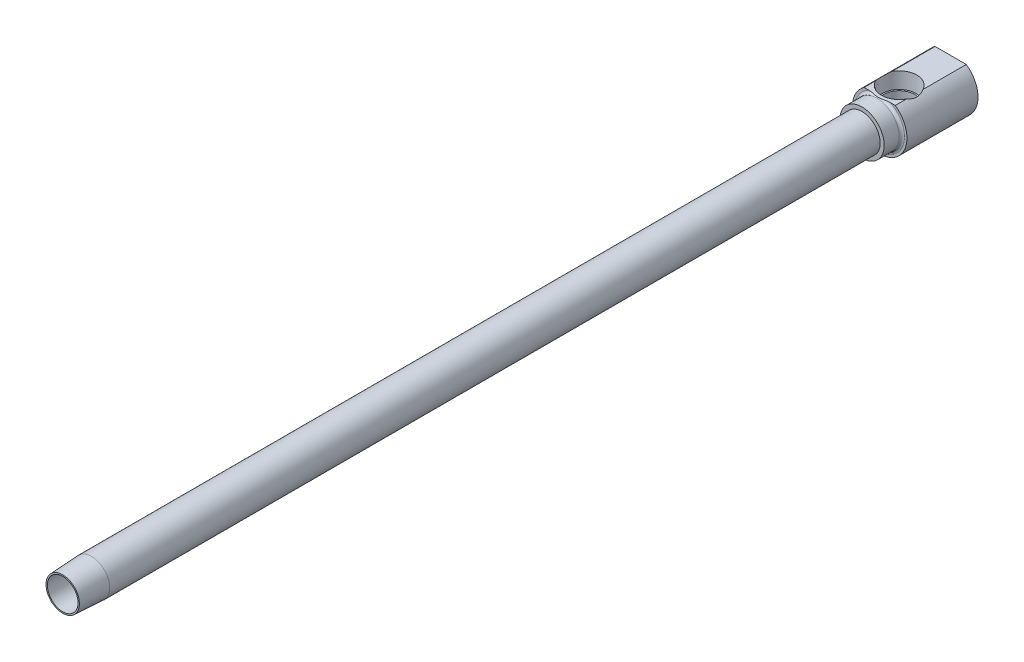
ISO-10303-21;
HEADER;
FILE_DESCRIPTION(('STEP AP214'),'2;1');
FILE_NAME('part.step','',(''),(''),'','','');
FILE_SCHEMA(('AUTOMOTIVE_DESIGN { 1 0 10303 214 1 1 1 1 }'));
ENDSEC;
DATA;
#1=APPLICATION_CONTEXT('core data for automotive mechanical design processes');
#2=APPLICATION_PROTOCOL_DEFINITION('international standard','automotive_design',2000,#1);
#3=PRODUCT_CONTEXT('',#1,'mechanical');
#4=PRODUCT('Part','Part','',(#3));
#5=PRODUCT_RELATED_PRODUCT_CATEGORY('part','',(#4));
#6=PRODUCT_DEFINITION_FORMATION('','',#4);
#7=PRODUCT_DEFINITION_CONTEXT('part definition',#1,'design');
#8=PRODUCT_DEFINITION('design','',#6,#7);
#9=PRODUCT_DEFINITION_SHAPE('','',#8);
#10=(LENGTH_UNIT() NAMED_UNIT(*) SI_UNIT(.MILLI.,.METRE.));
#11=(NAMED_UNIT(*) PLANE_ANGLE_UNIT() SI_UNIT($,.RADIAN.));
#12=(NAMED_UNIT(*) SI_UNIT($,.STERADIAN.) SOLID_ANGLE_UNIT());
#13=UNCERTAINTY_MEASURE_WITH_UNIT(LENGTH_MEASURE(1.E-05),#10,'distance_accuracy_value','');
#14=(GEOMETRIC_REPRESENTATION_CONTEXT(3) GLOBAL_UNCERTAINTY_ASSIGNED_CONTEXT((#13)) GLOBAL_UNIT_ASSIGNED_CONTEXT((#10,
#11,#12)) REPRESENTATION_CONTEXT('',''));
#15=CARTESIAN_POINT('',(0.,0.,0.));
#16=DIRECTION('',(0.,0.,1.));
#17=DIRECTION('',(1.,0.,0.));
#18=AXIS2_PLACEMENT_3D('',#15,#16,#17);
#19=CARTESIAN_POINT('',(-4.3815,0.,0.));
#20=DIRECTION('',(0.,0.,1.));
#21=DIRECTION('',(1.,0.,0.));
#22=AXIS2_PLACEMENT_3D('',#19,#20,#21);
#23=PLANE('',#22);
#24=CARTESIAN_POINT('',(0.,0.,0.));
#25=DIRECTION('',(0.,0.,-1.));
#26=DIRECTION('',(-1.,0.,0.));
#27=AXIS2_PLACEMENT_3D('',#24,#25,#26);
#28=CIRCLE('',#27,4.3815);
#29=CARTESIAN_POINT('',(-4.3815,0.,0.));
#30=VERTEX_POINT('',#29);
#31=EDGE_CURVE('E18',#30,#30,#28,.T.);
#32=ORIENTED_EDGE('',*,*,#31,.T.);
#33=EDGE_LOOP('',(#32));
#34=FACE_BOUND('',#33,.T.);
#35=CARTESIAN_POINT('',(0.,0.,0.));
#36=DIRECTION('',(0.,0.,-1.));
#37=DIRECTION('',(-1.,0.,0.));
#38=AXIS2_PLACEMENT_3D('',#35,#36,#37);
#39=CIRCLE('',#38,4.7752);
#40=CARTESIAN_POINT('',(-4.7752,0.,0.));
#41=VERTEX_POINT('',#40);
#42=EDGE_CURVE('E148',#41,#41,#39,.T.);
#43=ORIENTED_EDGE('',*,*,#42,.F.);
#44=EDGE_LOOP('',(#43));
#45=FACE_BOUND('',#44,.T.);
#46=ADVANCED_FACE('F15',(#34,#45),#23,.T.);
#47=CARTESIAN_POINT('',(0.,0.,-295.872366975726));
#48=DIRECTION('',(0.,0.,-1.));
#49=DIRECTION('',(-1.,0.,0.));
#50=AXIS2_PLACEMENT_3D('',#47,#48,#49);
#51=CYLINDRICAL_SURFACE('',#50,5.207);
#52=CARTESIAN_POINT('',(0.,0.,-8.23923482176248));
#53=DIRECTION('',(0.,0.,-1.));
#54=DIRECTION('',(-1.,0.,0.));
#55=AXIS2_PLACEMENT_3D('',#52,#53,#54);
#56=CIRCLE('',#55,5.207);
#57=CARTESIAN_POINT('',(-5.207,0.,-8.23923482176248));
#58=VERTEX_POINT('',#57);
#59=EDGE_CURVE('E150',#58,#58,#56,.T.);
#60=ORIENTED_EDGE('',*,*,#59,.T.);
#61=EDGE_LOOP('',(#60));
#62=FACE_BOUND('',#61,.T.);
#63=CARTESIAN_POINT('',(0.,0.,-228.6254));
#64=DIRECTION('',(0.,0.,-1.));
#65=DIRECTION('',(-1.,0.,0.));
#66=AXIS2_PLACEMENT_3D('',#63,#64,#65);
#67=CIRCLE('',#66,5.207);
#68=CARTESIAN_POINT('',(-5.207,0.,-228.6254));
#69=VERTEX_POINT('',#68);
#70=EDGE_CURVE('E240',#69,#69,#67,.T.);
#71=ORIENTED_EDGE('',*,*,#70,.F.);
#72=EDGE_LOOP('',(#71));
#73=FACE_BOUND('',#72,.T.);
#74=ADVANCED_FACE('F135',(#62,#73),#51,.T.);
#75=CARTESIAN_POINT('',(-4.4577,6.41348742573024,-220.6752));
#76=DIRECTION('',(0.,-1.,0.));
#77=DIRECTION('',(0.,0.,-1.));
#78=AXIS2_PLACEMENT_3D('',#75,#76,#77);
#79=PLANE('',#78);
#80=DIRECTION('',(0.,0.,-1.));
#81=VECTOR('',#80,1.);
#82=CARTESIAN_POINT('',(4.4577,6.41348742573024,-220.6752));
#83=LINE('',#82,#81);
#84=CARTESIAN_POINT('',(4.4577,6.41348742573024,-233.68));
#85=VERTEX_POINT('',#84);
#86=CARTESIAN_POINT('',(4.4577,6.41348742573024,-236.921408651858));
#87=VERTEX_POINT('',#86);
#88=EDGE_CURVE('E293',#85,#87,#83,.T.);
#89=ORIENTED_EDGE('',*,*,#88,.T.);
#90=CARTESIAN_POINT('',(0.,6.41348742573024,-239.268));
#91=DIRECTION('',(0.,-1.,0.));
#92=DIRECTION('',(0.,0.,-1.));
#93=AXIS2_PLACEMENT_3D('',#90,#91,#92);
#94=CIRCLE('',#93,5.03761652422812);
#95=CARTESIAN_POINT('',(-4.4577,6.41348742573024,-236.921408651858));
#96=VERTEX_POINT('',#95);
#97=EDGE_CURVE('E157',#87,#96,#94,.T.);
#98=ORIENTED_EDGE('',*,*,#97,.T.);
#99=DIRECTION('',(0.,0.,-1.));
#100=VECTOR('',#99,1.);
#101=CARTESIAN_POINT('',(-4.4577,6.41348742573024,-220.6752));
#102=LINE('',#101,#100);
#103=CARTESIAN_POINT('',(-4.4577,6.41348742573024,-233.68));
#104=VERTEX_POINT('',#103);
#105=EDGE_CURVE('E291',#104,#96,#102,.T.);
#106=ORIENTED_EDGE('',*,*,#105,.F.);
#107=DIRECTION('',(1.,0.,0.));
#108=VECTOR('',#107,1.);
#109=CARTESIAN_POINT('',(-7.112,6.41348742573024,-233.68));
#110=LINE('',#109,#108);
#111=CARTESIAN_POINT('',(-3.07371485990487,6.41348742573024,-233.68));
#112=VERTEX_POINT('',#111);
#113=EDGE_CURVE('E282',#104,#112,#110,.T.);
#114=ORIENTED_EDGE('',*,*,#113,.T.);
#115=CARTESIAN_POINT('',(0.,6.41348742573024,-233.222506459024));
#116=CARTESIAN_POINT('',(0.0547669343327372,6.41348742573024,-233.222502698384));
#117=CARTESIAN_POINT('',(0.109530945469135,6.41348742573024,-233.224131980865));
#118=CARTESIAN_POINT('',(0.218888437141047,6.41348742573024,-233.230434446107));
#119=CARTESIAN_POINT('',(0.273481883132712,6.41348742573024,-233.23510820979));
#120=CARTESIAN_POINT('',(0.437133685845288,6.41348742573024,-233.252954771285));
#121=CARTESIAN_POINT('',(0.545759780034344,6.41348742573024,-233.269948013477));
#122=CARTESIAN_POINT('',(0.763468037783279,6.41348742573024,-233.309460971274));
#123=CARTESIAN_POINT('',(0.872535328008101,6.41348742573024,-233.332054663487));
#124=CARTESIAN_POINT('',(1.09015205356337,6.41348742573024,-233.379005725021));
#125=CARTESIAN_POINT('',(1.19870193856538,6.41348742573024,-233.40336104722));
#126=CARTESIAN_POINT('',(1.441224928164,6.41348742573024,-233.457231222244));
#127=CARTESIAN_POINT('',(1.57522547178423,6.41348742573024,-233.486625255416));
#128=CARTESIAN_POINT('',(1.84407607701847,6.41348742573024,-233.541759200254));
#129=CARTESIAN_POINT('',(1.9789265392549,6.41348742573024,-233.567497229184));
#130=CARTESIAN_POINT('',(2.24890278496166,6.41348742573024,-233.612646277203));
#131=CARTESIAN_POINT('',(2.38402236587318,6.41348742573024,-233.632093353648));
#132=CARTESIAN_POINT('',(2.6552179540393,6.41348742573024,-233.662201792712));
#133=CARTESIAN_POINT('',(2.79129309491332,6.41348742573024,-233.672870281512));
#134=CARTESIAN_POINT('',(2.99640645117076,6.41348742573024,-233.679807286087));
#135=CARTESIAN_POINT('',(3.06529255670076,6.41348742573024,-233.680589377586));
#136=CARTESIAN_POINT('',(3.20300193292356,6.41348742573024,-233.678500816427));
#137=CARTESIAN_POINT('',(3.27182521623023,6.41348742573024,-233.675631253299));
#138=CARTESIAN_POINT('',(3.40907712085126,6.41348742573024,-233.665580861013));
#139=CARTESIAN_POINT('',(3.47750615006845,6.41348742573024,-233.658405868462));
#140=CARTESIAN_POINT('',(3.61360674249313,6.41348742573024,-233.638913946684));
#141=CARTESIAN_POINT('',(3.68127881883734,6.41348742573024,-233.626600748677));
#142=CARTESIAN_POINT('',(3.81134745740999,6.41348742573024,-233.596638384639));
#143=CARTESIAN_POINT('',(3.8738228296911,6.41348742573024,-233.579338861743));
#144=CARTESIAN_POINT('',(3.99661419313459,6.41348742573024,-233.537990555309));
#145=CARTESIAN_POINT('',(4.05692926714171,6.41348742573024,-233.513938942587));
#146=CARTESIAN_POINT('',(4.16438836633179,6.41348742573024,-233.461987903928));
#147=CARTESIAN_POINT('',(4.21210790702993,6.41348742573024,-233.435296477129));
#148=CARTESIAN_POINT('',(4.30289303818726,6.41348742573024,-233.374877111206));
#149=CARTESIAN_POINT('',(4.34597104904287,6.41348742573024,-233.341168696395));
#150=CARTESIAN_POINT('',(4.40881816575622,6.41348742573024,-233.280664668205));
#151=CARTESIAN_POINT('',(4.43105110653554,6.41348742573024,-233.256438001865));
#152=CARTESIAN_POINT('',(4.47168650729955,6.41348742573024,-233.204939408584));
#153=CARTESIAN_POINT('',(4.49009362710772,6.41348742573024,-233.177671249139));
#154=CARTESIAN_POINT('',(4.51921410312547,6.41348742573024,-233.12504266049));
#155=CARTESIAN_POINT('',(4.53069614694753,6.41348742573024,-233.100111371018));
#156=CARTESIAN_POINT('',(4.54935954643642,6.41348742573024,-233.04867800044));
#157=CARTESIAN_POINT('',(4.55654415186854,6.41348742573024,-233.022177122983));
#158=CARTESIAN_POINT('',(4.56604079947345,6.41348742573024,-232.968144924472));
#159=CARTESIAN_POINT('',(4.56832514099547,6.41348742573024,-232.940608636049));
#160=CARTESIAN_POINT('',(4.56771494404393,6.41348742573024,-232.885594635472));
#161=CARTESIAN_POINT('',(4.56482077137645,6.41348742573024,-232.858116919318));
#162=CARTESIAN_POINT('',(4.55461750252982,6.41348742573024,-232.806573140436));
#163=CARTESIAN_POINT('',(4.54772671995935,6.41348742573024,-232.782421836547));
#164=CARTESIAN_POINT('',(4.53037439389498,6.41348742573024,-232.735451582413));
#165=CARTESIAN_POINT('',(4.51991160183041,6.41348742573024,-232.712633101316));
#166=CARTESIAN_POINT('',(4.49089034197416,6.41348742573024,-232.659253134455));
#167=CARTESIAN_POINT('',(4.47078194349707,6.41348742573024,-232.629535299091));
#168=CARTESIAN_POINT('',(4.42607813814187,6.41348742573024,-232.573694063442));
#169=CARTESIAN_POINT('',(4.40147230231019,6.41348742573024,-232.5475792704));
#170=CARTESIAN_POINT('',(4.33512083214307,6.41348742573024,-232.485846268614));
#171=CARTESIAN_POINT('',(4.29121960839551,6.41348742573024,-232.452560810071));
#172=CARTESIAN_POINT('',(4.1989489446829,6.41348742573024,-232.392992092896));
#173=CARTESIAN_POINT('',(4.1505702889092,6.41348742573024,-232.366723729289));
#174=CARTESIAN_POINT('',(4.05679374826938,6.41348742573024,-232.322729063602));
#175=CARTESIAN_POINT('',(4.0116866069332,6.41348742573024,-232.304369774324));
#176=CARTESIAN_POINT('',(3.92005010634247,6.41348742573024,-232.271582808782));
#177=CARTESIAN_POINT('',(3.87351963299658,6.41348742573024,-232.257158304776));
#178=CARTESIAN_POINT('',(3.73245646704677,6.41348742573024,-232.218915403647));
#179=CARTESIAN_POINT('',(3.63654836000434,6.41348742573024,-232.2001691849));
#180=CARTESIAN_POINT('',(3.441107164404,6.41348742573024,-232.172600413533));
#181=CARTESIAN_POINT('',(3.34154251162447,6.41348742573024,-232.164028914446));
#182=CARTESIAN_POINT('',(3.14195452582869,6.41348742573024,-232.155217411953));
#183=CARTESIAN_POINT('',(3.04193075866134,6.41348742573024,-232.154988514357));
#184=CARTESIAN_POINT('',(2.84160218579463,6.41348742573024,-232.161135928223));
#185=CARTESIAN_POINT('',(2.74129862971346,6.41348742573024,-232.16754664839));
#186=CARTESIAN_POINT('',(2.54132534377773,6.41348742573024,-232.185618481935));
#187=CARTESIAN_POINT('',(2.4416549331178,6.41348742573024,-232.197272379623));
#188=CARTESIAN_POINT('',(2.13711894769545,6.41348742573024,-232.239263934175));
#189=CARTESIAN_POINT('',(1.93319771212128,6.41348742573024,-232.27628574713));
#190=CARTESIAN_POINT('',(1.62827949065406,6.41348742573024,-232.338357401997));
#191=CARTESIAN_POINT('',(1.52655364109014,6.41348742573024,-232.360199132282));
#192=CARTESIAN_POINT('',(1.32330984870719,6.41348742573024,-232.40483124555));
#193=CARTESIAN_POINT('',(1.22179189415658,6.41348742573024,-232.427621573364));
#194=CARTESIAN_POINT('',(1.0205863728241,6.41348742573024,-232.47212134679));
#195=CARTESIAN_POINT('',(0.920901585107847,6.41348742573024,-232.49384319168));
#196=CARTESIAN_POINT('',(0.720902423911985,6.41348742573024,-232.53448684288));
#197=CARTESIAN_POINT('',(0.620587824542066,6.41348742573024,-232.553407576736));
#198=CARTESIAN_POINT('',(0.419827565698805,6.41348742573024,-232.584865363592));
#199=CARTESIAN_POINT('',(0.319392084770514,6.41348742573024,-232.597460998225));
#200=CARTESIAN_POINT('',(0.168224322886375,6.41348742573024,-232.608901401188));
#201=CARTESIAN_POINT('',(0.117779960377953,6.41348742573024,-232.611473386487));
#202=CARTESIAN_POINT('',(0.0168277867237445,6.41348742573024,-232.61389611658));
#203=CARTESIAN_POINT('',(-0.0336800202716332,6.41348742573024,-232.613747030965));
#204=CARTESIAN_POINT('',(-0.167203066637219,6.41348742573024,-232.609734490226));
#205=CARTESIAN_POINT('',(-0.250151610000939,6.41348742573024,-232.603534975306));
#206=CARTESIAN_POINT('',(-0.41540653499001,6.41348742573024,-232.585308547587));
#207=CARTESIAN_POINT('',(-0.497712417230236,6.41348742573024,-232.573277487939));
#208=CARTESIAN_POINT('',(-0.662364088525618,6.41348742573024,-232.545484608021));
#209=CARTESIAN_POINT('',(-0.744704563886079,6.41348742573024,-232.529692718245));
#210=CARTESIAN_POINT('',(-0.9089542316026,6.41348742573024,-232.496225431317));
#211=CARTESIAN_POINT('',(-0.990863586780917,6.41348742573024,-232.478550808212));
#212=CARTESIAN_POINT('',(-1.15599570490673,6.41348742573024,-232.4422569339));
#213=CARTESIAN_POINT('',(-1.23921597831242,6.41348742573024,-232.423626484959));
#214=CARTESIAN_POINT('',(-1.40572088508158,6.41348742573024,-232.386671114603));
#215=CARTESIAN_POINT('',(-1.48900551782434,6.41348742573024,-232.36834619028));
#216=CARTESIAN_POINT('',(-1.73866654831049,6.41348742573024,-232.315071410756));
#217=CARTESIAN_POINT('',(-1.90540243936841,6.41348742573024,-232.28168897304));
#218=CARTESIAN_POINT('',(-2.16681921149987,6.41348742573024,-232.236734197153));
#219=CARTESIAN_POINT('',(-2.26095047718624,6.41348742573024,-232.222025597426));
#220=CARTESIAN_POINT('',(-2.44971550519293,6.41348742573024,-232.196348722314));
#221=CARTESIAN_POINT('',(-2.5443491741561,6.41348742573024,-232.185379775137));
#222=CARTESIAN_POINT('',(-2.73368335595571,6.41348742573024,-232.168201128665));
#223=CARTESIAN_POINT('',(-2.82838206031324,6.41348742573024,-232.161972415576));
#224=CARTESIAN_POINT('',(-3.01793602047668,6.41348742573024,-232.155372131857));
#225=CARTESIAN_POINT('',(-3.11279113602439,6.41348742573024,-232.154996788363));
#226=CARTESIAN_POINT('',(-3.31218734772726,6.41348742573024,-232.161898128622));
#227=CARTESIAN_POINT('',(-3.41671052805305,6.41348742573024,-232.16997414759));
#228=CARTESIAN_POINT('',(-3.5723466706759,6.41348742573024,-232.190810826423));
#229=CARTESIAN_POINT('',(-3.62404703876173,6.41348742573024,-232.199213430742));
#230=CARTESIAN_POINT('',(-3.72677708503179,6.41348742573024,-232.219392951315));
#231=CARTESIAN_POINT('',(-3.77780699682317,6.41348742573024,-232.231168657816));
#232=CARTESIAN_POINT('',(-3.89634421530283,6.41348742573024,-232.263403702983));
#233=CARTESIAN_POINT('',(-3.96343170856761,6.41348742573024,-232.285458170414));
#234=CARTESIAN_POINT('',(-4.09405850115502,6.41348742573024,-232.338413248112));
#235=CARTESIAN_POINT('',(-4.15760463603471,6.41348742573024,-232.369296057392));
#236=CARTESIAN_POINT('',(-4.25441976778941,6.41348742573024,-232.427888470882));
#237=CARTESIAN_POINT('',(-4.28979385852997,6.41348742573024,-232.4520976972));
#238=CARTESIAN_POINT('',(-4.35685699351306,6.41348742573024,-232.505223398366));
#239=CARTESIAN_POINT('',(-4.38855051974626,6.41348742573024,-232.53413404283));
#240=CARTESIAN_POINT('',(-4.4393789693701,6.41348742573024,-232.589413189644));
#241=CARTESIAN_POINT('',(-4.45969325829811,6.41348742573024,-232.61468864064));
#242=CARTESIAN_POINT('',(-4.49606293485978,6.41348742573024,-232.66815327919));
#243=CARTESIAN_POINT('',(-4.51212457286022,6.41348742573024,-232.696338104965));
#244=CARTESIAN_POINT('',(-4.53626721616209,6.41348742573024,-232.749729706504));
#245=CARTESIAN_POINT('',(-4.54527744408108,6.41348742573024,-232.774513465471));
#246=CARTESIAN_POINT('',(-4.5590260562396,6.41348742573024,-232.825243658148));
#247=CARTESIAN_POINT('',(-4.56376753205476,6.41348742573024,-232.851189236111));
#248=CARTESIAN_POINT('',(-4.56859445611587,6.41348742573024,-232.903605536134));
#249=CARTESIAN_POINT('',(-4.5686642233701,6.41348742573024,-232.930077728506));
#250=CARTESIAN_POINT('',(-4.5641015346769,6.41348742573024,-232.982612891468));
#251=CARTESIAN_POINT('',(-4.55946793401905,6.41348742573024,-233.008675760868));
#252=CARTESIAN_POINT('',(-4.54620785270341,6.41348742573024,-233.058450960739));
#253=CARTESIAN_POINT('',(-4.5377761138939,6.41348742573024,-233.08221625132));
#254=CARTESIAN_POINT('',(-4.51754524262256,6.41348742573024,-233.128251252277));
#255=CARTESIAN_POINT('',(-4.50574488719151,6.41348742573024,-233.150520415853));
#256=CARTESIAN_POINT('',(-4.47265204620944,6.41348742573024,-233.204236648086));
#257=CARTESIAN_POINT('',(-4.44958451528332,6.41348742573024,-233.234590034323));
#258=CARTESIAN_POINT('',(-4.3989344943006,6.41348742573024,-233.291262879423));
#259=CARTESIAN_POINT('',(-4.37134039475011,6.41348742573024,-233.317571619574));
#260=CARTESIAN_POINT('',(-4.29637766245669,6.41348742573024,-233.380336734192));
#261=CARTESIAN_POINT('',(-4.2467063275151,6.41348742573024,-233.414023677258));
#262=CARTESIAN_POINT('',(-4.1429475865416,6.41348742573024,-233.473603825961));
#263=CARTESIAN_POINT('',(-4.08885088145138,6.41348742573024,-233.4994800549));
#264=CARTESIAN_POINT('',(-3.98330416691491,6.41348742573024,-233.54266584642));
#265=CARTESIAN_POINT('',(-3.93208515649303,6.41348742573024,-233.560552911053));
#266=CARTESIAN_POINT('',(-3.82828626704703,6.41348742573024,-233.591892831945));
#267=CARTESIAN_POINT('',(-3.77570527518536,6.41348742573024,-233.605341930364));
#268=CARTESIAN_POINT('',(-3.66966451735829,6.41348742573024,-233.628467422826));
#269=CARTESIAN_POINT('',(-3.61620370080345,6.41348742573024,-233.638138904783));
#270=CARTESIAN_POINT('',(-3.50882362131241,6.41348742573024,-233.654213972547));
#271=CARTESIAN_POINT('',(-3.45490452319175,6.41348742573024,-233.660618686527));
#272=CARTESIAN_POINT('',(-3.32893010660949,6.41348742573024,-233.672254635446));
#273=CARTESIAN_POINT('',(-3.25677506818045,6.41348742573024,-233.676396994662));
#274=CARTESIAN_POINT('',(-3.11233636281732,6.41348742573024,-233.680499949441));
#275=CARTESIAN_POINT('',(-3.04005265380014,6.41348742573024,-233.680458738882));
#276=CARTESIAN_POINT('',(-2.82311145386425,6.41348742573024,-233.675065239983));
#277=CARTESIAN_POINT('',(-2.6785850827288,6.41348742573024,-233.664427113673));
#278=CARTESIAN_POINT('',(-2.38941343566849,6.41348742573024,-233.633026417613));
#279=CARTESIAN_POINT('',(-2.24477928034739,6.41348742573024,-233.612171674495));
#280=CARTESIAN_POINT('',(-1.95690250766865,6.41348742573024,-233.563578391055));
#281=CARTESIAN_POINT('',(-1.81365833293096,6.41348742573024,-233.535848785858));
#282=CARTESIAN_POINT('',(-1.53108031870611,6.41348742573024,-233.477154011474));
#283=CARTESIAN_POINT('',(-1.39172865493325,6.41348742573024,-233.44627129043));
#284=CARTESIAN_POINT('',(-1.18259583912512,6.41348742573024,-233.399745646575));
#285=CARTESIAN_POINT('',(-1.11279428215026,6.41348742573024,-233.384187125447));
#286=CARTESIAN_POINT('',(-0.973069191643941,6.41348742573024,-233.353631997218));
#287=CARTESIAN_POINT('',(-0.90314566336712,6.41348742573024,-233.338635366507));
#288=CARTESIAN_POINT('',(-0.76429608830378,6.41348742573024,-233.310259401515));
#289=CARTESIAN_POINT('',(-0.695375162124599,6.41348742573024,-233.296855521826));
#290=CARTESIAN_POINT('',(-0.557105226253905,6.41348742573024,-233.272372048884));
#291=CARTESIAN_POINT('',(-0.487756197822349,6.41348742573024,-233.261292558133));
#292=CARTESIAN_POINT('',(-0.348841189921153,6.41348742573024,-233.242764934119));
#293=CARTESIAN_POINT('',(-0.27927725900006,6.41348742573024,-233.235302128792));
#294=CARTESIAN_POINT('',(-0.139807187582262,6.41348742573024,-233.225176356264));
#295=CARTESIAN_POINT('',(-0.0699012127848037,6.41348742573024,-233.222511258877));
#296=CARTESIAN_POINT('',(0.,6.41348742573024,-233.222506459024));
#297=B_SPLINE_CURVE_WITH_KNOTS('',3,(#115,#116,#117,#118,#119,#120,#121,#122,#123,#124,#125,
#126,#127,#128,#129,#130,#131,#132,#133,#134,#135,#136,#137,#138,#139,#140,#141,#142,#143,#144,
#145,#146,#147,#148,#149,#150,#151,#152,#153,#154,#155,#156,#157,#158,#159,#160,#161,#162,#163,
#164,#165,#166,#167,#168,#169,#170,#171,#172,#173,#174,#175,#176,#177,#178,#179,#180,#181,#182,
#183,#184,#185,#186,#187,#188,#189,#190,#191,#192,#193,#194,#195,#196,#197,#198,#199,#200,#201,
#202,#203,#204,#205,#206,#207,#208,#209,#210,#211,#212,#213,#214,#215,#216,#217,#218,#219,#220,
#221,#222,#223,#224,#225,#226,#227,#228,#229,#230,#231,#232,#233,#234,#235,#236,#237,#238,#239,
#240,#241,#242,#243,#244,#245,#246,#247,#248,#249,#250,#251,#252,#253,#254,#255,#256,#257,#258,
#259,#260,#261,#262,#263,#264,#265,#266,#267,#268,#269,#270,#271,#272,#273,#274,#275,#276,#277,
#278,#279,#280,#281,#282,#283,#284,#285,#286,#287,#288,#289,#290,#291,#292,#293,#294,#295,#296),
.UNSPECIFIED.,.T.,.F.,(4,2,2,2,2,2,2,2,2,2,2,2,2,2,2,2,2,2,2,2,2,2,2,2,2,2,2,2,2,2,2,2,2,2,2,2,
2,2,2,2,2,2,2,2,2,2,2,2,2,2,2,2,2,2,2,2,2,2,2,2,2,2,2,2,2,2,2,2,2,2,2,2,2,2,2,2,2,2,2,2,2,2,2,2,
2,2,2,2,2,2,4),(0.,0.164273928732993,0.32857921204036,0.658096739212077,0.992223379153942,
1.32596779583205,1.737515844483,2.14927506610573,2.55863060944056,2.96765352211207,
3.17424892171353,3.38078269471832,3.58703711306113,3.79314201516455,3.98733137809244,
4.18160222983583,4.34518473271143,4.50831802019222,4.60668262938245,4.70492671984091,
4.78693922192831,4.86888962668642,4.95130208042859,5.03370871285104,5.10874003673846,
5.18379761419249,5.29083718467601,5.39812818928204,5.56248306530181,5.72718409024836,
5.87307196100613,6.01907710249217,6.31139884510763,6.6107926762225,6.91058505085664,
7.21193886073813,7.51287920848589,8.13412004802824,8.44626765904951,8.75839714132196,
9.06445930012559,9.37063833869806,9.67392675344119,9.82538795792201,9.9768397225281,
10.2260774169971,10.4754926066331,10.7269732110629,10.9783508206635,11.2341897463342,
11.4900262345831,11.9999950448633,12.2857569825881,12.5714675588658,12.8560259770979,
13.1404009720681,13.4543312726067,13.6113768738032,13.7683662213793,13.9797728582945,
14.1907561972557,14.3190471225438,14.4471801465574,14.5441362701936,14.6409490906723,
14.7197308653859,14.7984555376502,14.8774444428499,14.9564525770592,15.0318037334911,
15.1071822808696,15.2209045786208,15.3349232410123,15.5139662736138,15.6933957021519,
15.8559161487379,16.0185738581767,16.1814423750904,16.3442546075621,16.5609200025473,
16.7776789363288,17.2118589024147,17.6500302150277,18.0876350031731,18.5158248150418,
18.7303690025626,18.9449041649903,19.1555191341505,19.3661433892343,19.5759058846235,
19.7855752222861),.UNSPECIFIED.);
#298=CARTESIAN_POINT('',(3.07371485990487,6.41348742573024,-233.68));
#299=VERTEX_POINT('',#298);
#300=EDGE_CURVE('E232',#112,#299,#297,.T.);
#301=ORIENTED_EDGE('',*,*,#300,.T.);
#302=EDGE_CURVE('E297',#299,#85,#110,.T.);
#303=ORIENTED_EDGE('',*,*,#302,.T.);
#304=EDGE_LOOP('',(#89,#98,#106,#114,#301,#303));
#305=FACE_BOUND('',#304,.T.);
#306=ADVANCED_FACE('F141',(#305),#79,.F.);
#307=CARTESIAN_POINT('',(0.,0.,-295.872366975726));
#308=DIRECTION('',(0.,0.,-1.));
#309=DIRECTION('',(-1.,0.,0.));
#310=AXIS2_PLACEMENT_3D('',#307,#308,#309);
#311=CYLINDRICAL_SURFACE('',#310,4.3815);
#312=ORIENTED_EDGE('',*,*,#31,.F.);
#313=EDGE_LOOP('',(#312));
#314=FACE_BOUND('',#313,.T.);
#315=CARTESIAN_POINT('',(0.,0.,-228.6254));
#316=DIRECTION('',(0.,0.,-1.));
#317=DIRECTION('',(-1.,0.,0.));
#318=AXIS2_PLACEMENT_3D('',#315,#316,#317);
#319=CIRCLE('',#318,4.3815);
#320=CARTESIAN_POINT('',(-3.16538744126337,-3.02949906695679,-228.6254));
#321=VERTEX_POINT('',#320);
#322=CARTESIAN_POINT('',(3.16538744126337,-3.02949906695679,-228.6254));
#323=VERTEX_POINT('',#322);
#324=EDGE_CURVE('E235',#321,#323,#319,.T.);
#325=ORIENTED_EDGE('',*,*,#324,.T.);
#326=CARTESIAN_POINT('',(3.16547479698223,-3.02940779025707,-228.6256));
#327=CARTESIAN_POINT('',(3.14342446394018,-3.05243943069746,-228.575077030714));
#328=CARTESIAN_POINT('',(3.11972293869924,-3.07670954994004,-228.525848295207));
#329=CARTESIAN_POINT('',(3.0688820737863,-3.12742914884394,-228.430394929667));
#330=CARTESIAN_POINT('',(3.04174325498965,-3.1538782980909,-228.384169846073));
#331=CARTESIAN_POINT('',(2.95559153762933,-3.23545829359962,-228.251577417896));
#332=CARTESIAN_POINT('',(2.89136505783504,-3.29334010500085,-228.170167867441));
#333=CARTESIAN_POINT('',(2.75011359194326,-3.41217163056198,-228.022271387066));
#334=CARTESIAN_POINT('',(2.67308610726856,-3.47312194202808,-227.95578737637));
#335=CARTESIAN_POINT('',(2.50819184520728,-3.59402230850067,-227.83634210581));
#336=CARTESIAN_POINT('',(2.42029620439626,-3.653969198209,-227.783418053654));
#337=CARTESIAN_POINT('',(2.25775713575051,-3.75593106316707,-227.700236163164));
#338=CARTESIAN_POINT('',(2.18486784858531,-3.79884421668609,-227.667575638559));
#339=CARTESIAN_POINT('',(2.03488862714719,-3.88124850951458,-227.607990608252));
#340=CARTESIAN_POINT('',(1.9577967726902,-3.92073806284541,-227.581068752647));
#341=CARTESIAN_POINT('',(1.80004579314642,-3.99562399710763,-227.532117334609));
#342=CARTESIAN_POINT('',(1.71938265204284,-4.03101559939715,-227.510093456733));
#343=CARTESIAN_POINT('',(1.55515017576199,-4.09718246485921,-227.470304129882));
#344=CARTESIAN_POINT('',(1.47157967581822,-4.12795585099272,-227.452540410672));
#345=CARTESIAN_POINT('',(1.21289030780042,-4.2142585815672,-227.404005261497));
#346=CARTESIAN_POINT('',(1.03389313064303,-4.26180132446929,-227.379192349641));
#347=CARTESIAN_POINT('',(0.670227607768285,-4.33390350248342,-227.342389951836));
#348=CARTESIAN_POINT('',(0.485562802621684,-4.35847699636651,-227.330392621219));
#349=CARTESIAN_POINT('',(0.191999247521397,-4.37863265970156,-227.320580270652));
#350=CARTESIAN_POINT('',(0.0836976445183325,-4.38203983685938,-227.31893316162));
#351=CARTESIAN_POINT('',(-0.13284208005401,-4.38082235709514,-227.319520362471));
#352=CARTESIAN_POINT('',(-0.241080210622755,-4.37619962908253,-227.321753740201));
#353=CARTESIAN_POINT('',(-0.456961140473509,-4.35895390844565,-227.330180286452));
#354=CARTESIAN_POINT('',(-0.56460246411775,-4.34631610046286,-227.336380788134));
#355=CARTESIAN_POINT('',(-0.778298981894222,-4.31317491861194,-227.35296127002));
#356=CARTESIAN_POINT('',(-0.8843548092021,-4.29267477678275,-227.363339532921));
#357=CARTESIAN_POINT('',(-1.09632494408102,-4.24354696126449,-227.388913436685));
#358=CARTESIAN_POINT('',(-1.20219105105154,-4.21476010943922,-227.404204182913));
#359=CARTESIAN_POINT('',(-1.41060084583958,-4.14965783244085,-227.440134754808));
#360=CARTESIAN_POINT('',(-1.51314609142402,-4.11334599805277,-227.460772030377));
#361=CARTESIAN_POINT('',(-1.71390456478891,-4.03381995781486,-227.508258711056));
#362=CARTESIAN_POINT('',(-1.81212318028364,-3.99061466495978,-227.535100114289));
#363=CARTESIAN_POINT('',(-2.00320334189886,-3.8982035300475,-227.596192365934));
#364=CARTESIAN_POINT('',(-2.09606839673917,-3.84900168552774,-227.630438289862));
#365=CARTESIAN_POINT('',(-2.29534319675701,-3.73428068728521,-227.716661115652));
#366=CARTESIAN_POINT('',(-2.40014619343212,-3.66757137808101,-227.770889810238));
#367=CARTESIAN_POINT('',(-2.54748315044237,-3.56531535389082,-227.864688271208));
#368=CARTESIAN_POINT('',(-2.59488453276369,-3.53092006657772,-227.89796870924));
#369=CARTESIAN_POINT('',(-2.68608105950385,-3.46204578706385,-227.969051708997));
#370=CARTESIAN_POINT('',(-2.72987823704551,-3.42756685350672,-228.006851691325));
#371=CARTESIAN_POINT('',(-2.81247040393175,-3.36010888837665,-228.086220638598));
#372=CARTESIAN_POINT('',(-2.85136068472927,-3.32711374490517,-228.127676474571));
#373=CARTESIAN_POINT('',(-2.92505072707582,-3.26251751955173,-228.215085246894));
#374=CARTESIAN_POINT('',(-2.95985031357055,-3.23091649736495,-228.261038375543));
#375=CARTESIAN_POINT('',(-3.02566242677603,-3.16938090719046,-228.357865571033));
#376=CARTESIAN_POINT('',(-3.05661307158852,-3.13947696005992,-228.408801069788));
#377=CARTESIAN_POINT('',(-3.11423662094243,-3.0823220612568,-228.514485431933));
#378=CARTESIAN_POINT('',(-3.14090735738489,-3.05507245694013,-228.569236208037));
#379=CARTESIAN_POINT('',(-3.16547479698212,-3.02940779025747,-228.6256));
#380=B_SPLINE_CURVE_WITH_KNOTS('',3,(#326,#327,#328,#329,#330,#331,#332,#333,#334,#335,#336,
#337,#338,#339,#340,#341,#342,#343,#344,#345,#346,#347,#348,#349,#350,#351,#352,#353,#354,#355,
#356,#357,#358,#359,#360,#361,#362,#363,#364,#365,#366,#367,#368,#369,#370,#371,#372,#373,#374,
#375,#376,#377,#378,#379),.UNSPECIFIED.,.F.,.F.,(4,2,2,2,2,2,2,2,2,2,2,2,2,2,2,2,2,2,2,2,2,2,2,
2,2,2,4),(0.,0.179155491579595,0.358283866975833,0.712611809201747,1.06700899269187,
1.42236845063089,1.69403668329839,1.96583010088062,2.23793733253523,2.51015486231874,
3.06856026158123,3.62662365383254,3.95140246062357,4.27610326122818,4.60140600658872,
4.92657516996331,5.2584629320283,5.59019268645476,5.92149695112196,6.25258155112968,
6.65760632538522,6.85948934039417,7.06125768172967,7.25815107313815,7.45505288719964,
7.65479552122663,7.85463902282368),.UNSPECIFIED.);
#381=EDGE_CURVE('E203',#323,#321,#380,.T.);
#382=ORIENTED_EDGE('',*,*,#381,.T.);
#383=EDGE_LOOP('',(#325,#382));
#384=FACE_BOUND('',#383,.T.);
#385=ADVANCED_FACE('F234',(#314,#384),#311,.F.);
#386=CARTESIAN_POINT('',(-4.3815,0.,-228.6254));
#387=DIRECTION('',(0.,0.,1.));
#388=DIRECTION('',(1.,0.,0.));
#389=AXIS2_PLACEMENT_3D('',#386,#387,#388);
#390=PLANE('',#389);
#391=ORIENTED_EDGE('',*,*,#324,.F.);
#392=CARTESIAN_POINT('',(0.,-0.364745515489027,-228.6254));
#393=DIRECTION('',(0.,0.,1.));
#394=DIRECTION('',(0.,1.,0.));
#395=AXIS2_PLACEMENT_3D('',#392,#393,#394);
#396=ELLIPSE('',#395,4.20023414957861,4.09504169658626);
#397=EDGE_CURVE('E195',#321,#323,#396,.F.);
#398=ORIENTED_EDGE('',*,*,#397,.T.);
#399=EDGE_LOOP('',(#391,#398));
#400=FACE_BOUND('',#399,.T.);
#401=ADVANCED_FACE('F237',(#400),#390,.T.);
#402=CARTESIAN_POINT('',(-5.207,0.,-228.6254));
#403=DIRECTION('',(0.,0.,1.));
#404=DIRECTION('',(1.,0.,0.));
#405=AXIS2_PLACEMENT_3D('',#402,#403,#404);
#406=PLANE('',#405);
#407=ORIENTED_EDGE('',*,*,#70,.T.);
#408=EDGE_LOOP('',(#407));
#409=FACE_BOUND('',#408,.T.);
#410=CARTESIAN_POINT('',(0.,0.,-228.6254));
#411=DIRECTION('',(0.,0.,-1.));
#412=DIRECTION('',(-1.,0.,0.));
#413=AXIS2_PLACEMENT_3D('',#410,#411,#412);
#414=CIRCLE('',#413,6.35);
#415=CARTESIAN_POINT('',(-6.35,0.,-228.6254));
#416=VERTEX_POINT('',#415);
#417=EDGE_CURVE('E273',#416,#416,#414,.T.);
#418=ORIENTED_EDGE('',*,*,#417,.F.);
#419=EDGE_LOOP('',(#418));
#420=FACE_BOUND('',#419,.T.);
#421=ADVANCED_FACE('F382',(#409,#420),#406,.T.);
#422=CARTESIAN_POINT('',(-7.8105,0.,-254.));
#423=DIRECTION('',(0.,0.,-1.));
#424=DIRECTION('',(-1.,0.,0.));
#425=AXIS2_PLACEMENT_3D('',#422,#423,#424);
#426=PLANE('',#425);
#427=DIRECTION('',(1.,0.,0.));
#428=VECTOR('',#427,1.);
#429=CARTESIAN_POINT('',(-2.29502505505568,3.9751,-254.));
#430=LINE('',#429,#428);
#431=CARTESIAN_POINT('',(-2.29502505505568,3.9751,-254.));
#432=VERTEX_POINT('',#431);
#433=CARTESIAN_POINT('',(2.29502505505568,3.9751,-254.));
#434=VERTEX_POINT('',#433);
#435=EDGE_CURVE('E236',#432,#434,#430,.T.);
#436=ORIENTED_EDGE('',*,*,#435,.F.);
#437=DIRECTION('',(0.5,0.866025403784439,0.));
#438=VECTOR('',#437,1.);
#439=CARTESIAN_POINT('',(-4.59005011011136,0.,-254.));
#440=LINE('',#439,#438);
#441=CARTESIAN_POINT('',(-4.59005011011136,0.,-254.));
#442=VERTEX_POINT('',#441);
#443=EDGE_CURVE('E323',#442,#432,#440,.T.);
#444=ORIENTED_EDGE('',*,*,#443,.F.);
#445=DIRECTION('',(-0.5,0.866025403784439,0.));
#446=VECTOR('',#445,1.);
#447=CARTESIAN_POINT('',(-2.29502505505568,-3.9751,-254.));
#448=LINE('',#447,#446);
#449=CARTESIAN_POINT('',(-2.29502505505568,-3.9751,-254.));
#450=VERTEX_POINT('',#449);
#451=EDGE_CURVE('E327',#450,#442,#448,.T.);
#452=ORIENTED_EDGE('',*,*,#451,.F.);
#453=DIRECTION('',(-1.,0.,0.));
#454=VECTOR('',#453,1.);
#455=CARTESIAN_POINT('',(2.29502505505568,-3.9751,-254.));
#456=LINE('',#455,#454);
#457=CARTESIAN_POINT('',(2.29502505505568,-3.9751,-254.));
#458=VERTEX_POINT('',#457);
#459=EDGE_CURVE('E330',#458,#450,#456,.T.);
#460=ORIENTED_EDGE('',*,*,#459,.F.);
#461=DIRECTION('',(-0.5,-0.866025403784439,0.));
#462=VECTOR('',#461,1.);
#463=CARTESIAN_POINT('',(4.59005011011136,0.,-254.));
#464=LINE('',#463,#462);
#465=CARTESIAN_POINT('',(4.59005011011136,0.,-254.));
#466=VERTEX_POINT('',#465);
#467=EDGE_CURVE('E333',#466,#458,#464,.T.);
#468=ORIENTED_EDGE('',*,*,#467,.F.);
#469=DIRECTION('',(0.5,-0.866025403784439,0.));
#470=VECTOR('',#469,1.);
#471=CARTESIAN_POINT('',(2.29502505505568,3.9751,-254.));
#472=LINE('',#471,#470);
#473=EDGE_CURVE('E336',#434,#466,#472,.T.);
#474=ORIENTED_EDGE('',*,*,#473,.F.);
#475=EDGE_LOOP('',(#436,#444,#452,#460,#468,#474));
#476=FACE_BOUND('',#475,.T.);
#477=DIRECTION('',(-1.,0.,0.));
#478=VECTOR('',#477,1.);
#479=CARTESIAN_POINT('',(-4.4577,6.41348742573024,-254.));
#480=LINE('',#479,#478);
#481=CARTESIAN_POINT('',(4.4577,6.41348742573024,-254.));
#482=VERTEX_POINT('',#481);
#483=CARTESIAN_POINT('',(-4.4577,6.41348742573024,-254.));
#484=VERTEX_POINT('',#483);
#485=EDGE_CURVE('E306',#482,#484,#480,.T.);
#486=ORIENTED_EDGE('',*,*,#485,.F.);
#487=CARTESIAN_POINT('',(0.,0.,-254.));
#488=DIRECTION('',(0.,0.,-1.));
#489=DIRECTION('',(-1.,0.,0.));
#490=AXIS2_PLACEMENT_3D('',#487,#488,#489);
#491=CIRCLE('',#490,7.8105);
#492=EDGE_CURVE('E238',#482,#484,#491,.T.);
#493=ORIENTED_EDGE('',*,*,#492,.T.);
#494=EDGE_LOOP('',(#486,#493));
#495=FACE_BOUND('',#494,.T.);
#496=ADVANCED_FACE('F379',(#476,#495),#426,.T.);
#497=CARTESIAN_POINT('',(0.,0.,-295.872366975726));
#498=DIRECTION('',(0.,0.,-1.));
#499=DIRECTION('',(-1.,0.,0.));
#500=AXIS2_PLACEMENT_3D('',#497,#498,#499);
#501=CYLINDRICAL_SURFACE('',#500,7.8105);
#502=CARTESIAN_POINT('',(3.4919694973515,6.98641963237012,-235.595441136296));
#503=CARTESIAN_POINT('',(3.5890687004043,6.93789608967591,-235.691298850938));
#504=CARTESIAN_POINT('',(3.68214837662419,6.8888340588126,-235.79094030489));
#505=CARTESIAN_POINT('',(3.86002319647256,6.79075982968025,-235.997470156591));
#506=CARTESIAN_POINT('',(3.94481473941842,6.74174766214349,-236.104361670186));
#507=CARTESIAN_POINT('',(4.10630083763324,6.64463270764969,-236.325696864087));
#508=CARTESIAN_POINT('',(4.18293982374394,6.59653779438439,-236.440184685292));
#509=CARTESIAN_POINT('',(4.32709776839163,6.50288590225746,-236.675666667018));
#510=CARTESIAN_POINT('',(4.39461854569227,6.45732841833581,-236.79665952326));
#511=CARTESIAN_POINT('',(4.56617688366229,6.33809707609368,-237.135931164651));
#512=CARTESIAN_POINT('',(4.6607595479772,6.26825649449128,-237.360584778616));
#513=CARTESIAN_POINT('',(4.77884662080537,6.17810554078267,-237.708872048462));
#514=CARTESIAN_POINT('',(4.81422585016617,6.15050630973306,-237.82675439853));
#515=CARTESIAN_POINT('',(4.87674528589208,6.10105356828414,-238.065843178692));
#516=CARTESIAN_POINT('',(4.90388968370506,6.07919713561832,-238.18704788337));
#517=CARTESIAN_POINT('',(4.94976694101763,6.04190398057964,-238.433123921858));
#518=CARTESIAN_POINT('',(4.96842532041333,6.02652418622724,-238.558017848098));
#519=CARTESIAN_POINT('',(4.99667728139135,6.00312132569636,-238.809520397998));
#520=CARTESIAN_POINT('',(5.00627099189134,5.99509815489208,-238.936128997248));
#521=CARTESIAN_POINT('',(5.01621670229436,5.98677905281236,-239.189999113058));
#522=CARTESIAN_POINT('',(5.01656623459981,5.98648518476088,-239.317260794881));
#523=CARTESIAN_POINT('',(5.00801128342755,5.99364363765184,-239.571242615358));
#524=CARTESIAN_POINT('',(4.99910747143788,6.00109539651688,-239.697962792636));
#525=CARTESIAN_POINT('',(4.97354185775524,6.02229474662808,-239.937311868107));
#526=CARTESIAN_POINT('',(4.95773418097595,6.03534698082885,-240.050095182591));
#527=CARTESIAN_POINT('',(4.91896243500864,6.0669877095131,-240.273649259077));
#528=CARTESIAN_POINT('',(4.89599540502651,6.08557849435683,-240.384419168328));
#529=CARTESIAN_POINT('',(4.81679293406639,6.14874010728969,-240.712550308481));
#530=CARTESIAN_POINT('',(4.75021164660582,6.20073954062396,-240.926137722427));
#531=CARTESIAN_POINT('',(4.63945981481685,6.28338047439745,-241.215334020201));
#532=CARTESIAN_POINT('',(4.60576203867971,6.30815266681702,-241.296941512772));
#533=CARTESIAN_POINT('',(4.53447848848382,6.35958762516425,-241.457818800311));
#534=CARTESIAN_POINT('',(4.496893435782,6.38625004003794,-241.537089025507));
#535=CARTESIAN_POINT('',(4.3220534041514,6.50775479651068,-241.882823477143));
#536=CARTESIAN_POINT('',(4.16440692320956,6.61093131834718,-242.136395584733));
#537=CARTESIAN_POINT('',(3.80845756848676,6.82220207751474,-242.611369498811));
#538=CARTESIAN_POINT('',(3.61008660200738,6.93030431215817,-242.832716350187));
#539=CARTESIAN_POINT('',(3.29682765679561,7.08140586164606,-243.125508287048));
#540=CARTESIAN_POINT('',(3.19689867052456,7.12716323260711,-243.211836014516));
#541=CARTESIAN_POINT('',(2.99025804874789,7.21629286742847,-243.376495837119));
#542=CARTESIAN_POINT('',(2.88356945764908,7.25967238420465,-243.454852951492));
#543=CARTESIAN_POINT('',(2.77344990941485,7.30149887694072,-243.529155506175));
#544=B_SPLINE_CURVE_WITH_KNOTS('',3,(#502,#503,#504,#505,#506,#507,#508,#509,#510,#511,#512,
#513,#514,#515,#516,#517,#518,#519,#520,#521,#522,#523,#524,#525,#526,#527,#528,#529,#530,#531,
#532,#533,#534,#535,#536,#537,#538,#539,#540,#541,#542,#543),.UNSPECIFIED.,.F.,.F.,(4,2,2,2,2,2,
2,2,2,2,2,2,2,2,2,2,2,2,2,2,4),(0.,0.434323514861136,0.868834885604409,1.30614015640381,
1.7433580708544,2.50066107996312,2.87871388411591,3.25657393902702,3.63768926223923,
4.01879916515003,4.40001079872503,4.78119477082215,5.12468887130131,5.46832521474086,
6.15438371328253,6.42940501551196,6.70437537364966,7.64709414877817,8.59140221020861,
9.01031754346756,9.42787448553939),.UNSPECIFIED.);
#545=CARTESIAN_POINT('',(4.4577,6.41348742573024,-241.614591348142));
#546=VERTEX_POINT('',#545);
#547=EDGE_CURVE('E30',#87,#546,#544,.T.);
#548=ORIENTED_EDGE('',*,*,#547,.F.);
#549=ORIENTED_EDGE('',*,*,#88,.F.);
#550=CARTESIAN_POINT('',(0.,0.,-233.68));
#551=DIRECTION('',(0.,0.,-1.));
#552=DIRECTION('',(-1.,0.,0.));
#553=AXIS2_PLACEMENT_3D('',#550,#551,#552);
#554=CIRCLE('',#553,7.8105);
#555=EDGE_CURVE('E242',#85,#104,#554,.T.);
#556=ORIENTED_EDGE('',*,*,#555,.T.);
#557=ORIENTED_EDGE('',*,*,#105,.T.);
#558=CARTESIAN_POINT('',(-3.4919694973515,6.98641963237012,-242.940558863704));
#559=CARTESIAN_POINT('',(-3.5890687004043,6.9378960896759,-242.844701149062));
#560=CARTESIAN_POINT('',(-3.6821483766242,6.8888340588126,-242.74505969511));
#561=CARTESIAN_POINT('',(-3.86002319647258,6.79075982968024,-242.538529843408));
#562=CARTESIAN_POINT('',(-3.94481473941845,6.74174766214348,-242.431638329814));
#563=CARTESIAN_POINT('',(-4.10630083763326,6.64463270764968,-242.210303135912));
#564=CARTESIAN_POINT('',(-4.18293982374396,6.59653779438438,-242.095815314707));
#565=CARTESIAN_POINT('',(-4.32709776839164,6.50288590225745,-241.860333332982));
#566=CARTESIAN_POINT('',(-4.39461854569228,6.45732841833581,-241.73934047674));
#567=CARTESIAN_POINT('',(-4.5661768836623,6.33809707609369,-241.400068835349));
#568=CARTESIAN_POINT('',(-4.6607595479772,6.26825649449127,-241.175415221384));
#569=CARTESIAN_POINT('',(-4.77884662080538,6.17810554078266,-240.827127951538));
#570=CARTESIAN_POINT('',(-4.81422585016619,6.15050630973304,-240.70924560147));
#571=CARTESIAN_POINT('',(-4.87674528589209,6.10105356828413,-240.470156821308));
#572=CARTESIAN_POINT('',(-4.90388968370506,6.07919713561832,-240.34895211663));
#573=CARTESIAN_POINT('',(-4.94976694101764,6.04190398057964,-240.102876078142));
#574=CARTESIAN_POINT('',(-4.96842532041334,6.02652418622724,-239.977982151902));
#575=CARTESIAN_POINT('',(-4.99667728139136,6.00312132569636,-239.726479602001));
#576=CARTESIAN_POINT('',(-5.00627099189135,5.99509815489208,-239.599871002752));
#577=CARTESIAN_POINT('',(-5.01621670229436,5.98677905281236,-239.346000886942));
#578=CARTESIAN_POINT('',(-5.0165662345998,5.98648518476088,-239.218739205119));
#579=CARTESIAN_POINT('',(-5.00801128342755,5.99364363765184,-238.964757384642));
#580=CARTESIAN_POINT('',(-4.99910747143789,6.00109539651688,-238.838037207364));
#581=CARTESIAN_POINT('',(-4.97354185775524,6.02229474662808,-238.598688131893));
#582=CARTESIAN_POINT('',(-4.95773418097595,6.03534698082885,-238.485904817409));
#583=CARTESIAN_POINT('',(-4.91896243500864,6.0669877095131,-238.262350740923));
#584=CARTESIAN_POINT('',(-4.8959954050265,6.08557849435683,-238.151580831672));
#585=CARTESIAN_POINT('',(-4.81679293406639,6.1487401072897,-237.823449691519));
#586=CARTESIAN_POINT('',(-4.75021164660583,6.20073954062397,-237.609862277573));
#587=CARTESIAN_POINT('',(-4.63945981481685,6.28338047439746,-237.320665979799));
#588=CARTESIAN_POINT('',(-4.6057620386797,6.30815266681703,-237.239058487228));
#589=CARTESIAN_POINT('',(-4.53447848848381,6.35958762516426,-237.078181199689));
#590=CARTESIAN_POINT('',(-4.49689343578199,6.38625004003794,-236.998910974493));
#591=CARTESIAN_POINT('',(-4.3220534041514,6.50775479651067,-236.653176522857));
#592=CARTESIAN_POINT('',(-4.16440692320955,6.61093131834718,-236.399604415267));
#593=CARTESIAN_POINT('',(-3.80845756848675,6.82220207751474,-235.924630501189));
#594=CARTESIAN_POINT('',(-3.61008660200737,6.93030431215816,-235.703283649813));
#595=CARTESIAN_POINT('',(-3.29682765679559,7.08140586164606,-235.410491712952));
#596=CARTESIAN_POINT('',(-3.19689867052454,7.12716323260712,-235.324163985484));
#597=CARTESIAN_POINT('',(-2.99025804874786,7.21629286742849,-235.159504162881));
#598=CARTESIAN_POINT('',(-2.88356945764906,7.25967238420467,-235.081147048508));
#599=CARTESIAN_POINT('',(-2.77344990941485,7.30149887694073,-235.006844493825));
#600=B_SPLINE_CURVE_WITH_KNOTS('',3,(#558,#559,#560,#561,#562,#563,#564,#565,#566,#567,#568,
#569,#570,#571,#572,#573,#574,#575,#576,#577,#578,#579,#580,#581,#582,#583,#584,#585,#586,#587,
#588,#589,#590,#591,#592,#593,#594,#595,#596,#597,#598,#599),.UNSPECIFIED.,.F.,.F.,(4,2,2,2,2,2,
2,2,2,2,2,2,2,2,2,2,2,2,2,2,4),(0.,0.434323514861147,0.868834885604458,1.30614015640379,
1.74335807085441,2.50066107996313,2.87871388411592,3.256573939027,3.63768926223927,
4.01879916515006,4.40001079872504,4.78119477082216,5.12468887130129,5.46832521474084,
6.15438371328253,6.42940501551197,6.70437537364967,7.64709414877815,8.59140221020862,
9.01031754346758,9.4278744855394),.UNSPECIFIED.);
#601=CARTESIAN_POINT('',(-4.4577,6.41348742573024,-241.614591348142));
#602=VERTEX_POINT('',#601);
#603=EDGE_CURVE('E164',#602,#96,#600,.T.);
#604=ORIENTED_EDGE('',*,*,#603,.F.);
#605=EDGE_CURVE('E303',#602,#484,#102,.T.);
#606=ORIENTED_EDGE('',*,*,#605,.T.);
#607=ORIENTED_EDGE('',*,*,#492,.F.);
#608=EDGE_CURVE('E304',#546,#482,#83,.T.);
#609=ORIENTED_EDGE('',*,*,#608,.F.);
#610=EDGE_LOOP('',(#548,#549,#556,#557,#604,#606,#607,#609));
#611=FACE_BOUND('',#610,.T.);
#612=ADVANCED_FACE('F175',(#611),#501,.T.);
#613=CARTESIAN_POINT('',(-7.112,0.,-233.68));
#614=DIRECTION('',(0.,0.,1.));
#615=DIRECTION('',(1.,0.,0.));
#616=AXIS2_PLACEMENT_3D('',#613,#614,#615);
#617=PLANE('',#616);
#618=ORIENTED_EDGE('',*,*,#113,.F.);
#619=ORIENTED_EDGE('',*,*,#555,.F.);
#620=ORIENTED_EDGE('',*,*,#302,.F.);
#621=CARTESIAN_POINT('',(0.,0.,-233.68));
#622=DIRECTION('',(0.,0.,-1.));
#623=DIRECTION('',(-1.,0.,0.));
#624=AXIS2_PLACEMENT_3D('',#621,#622,#623);
#625=CIRCLE('',#624,7.112);
#626=EDGE_CURVE('E278',#299,#112,#625,.T.);
#627=ORIENTED_EDGE('',*,*,#626,.T.);
#628=EDGE_LOOP('',(#618,#619,#620,#627));
#629=FACE_BOUND('',#628,.T.);
#630=ADVANCED_FACE('F268',(#629),#617,.T.);
#631=CARTESIAN_POINT('',(0.,0.,-232.918));
#632=DIRECTION('',(0.,0.,-1.));
#633=DIRECTION('',(-1.,0.,0.));
#634=AXIS2_PLACEMENT_3D('',#631,#632,#633);
#635=TOROIDAL_SURFACE('',#634,7.112,0.762);
#636=ORIENTED_EDGE('',*,*,#300,.F.);
#637=ORIENTED_EDGE('',*,*,#626,.F.);
#638=EDGE_LOOP('',(#636,#637));
#639=FACE_BOUND('',#638,.T.);
#640=CARTESIAN_POINT('',(0.,0.,-232.918));
#641=DIRECTION('',(0.,0.,-1.));
#642=DIRECTION('',(-1.,0.,0.));
#643=AXIS2_PLACEMENT_3D('',#640,#641,#642);
#644=CIRCLE('',#643,6.35);
#645=CARTESIAN_POINT('',(-6.35,0.,-232.918));
#646=VERTEX_POINT('',#645);
#647=EDGE_CURVE('E276',#646,#646,#644,.T.);
#648=ORIENTED_EDGE('',*,*,#647,.T.);
#649=EDGE_LOOP('',(#648));
#650=FACE_BOUND('',#649,.T.);
#651=ADVANCED_FACE('F251',(#639,#650),#635,.F.);
#652=CARTESIAN_POINT('',(0.,0.,-295.872366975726));
#653=DIRECTION('',(0.,0.,-1.));
#654=DIRECTION('',(-1.,0.,0.));
#655=AXIS2_PLACEMENT_3D('',#652,#653,#654);
#656=CYLINDRICAL_SURFACE('',#655,6.35);
#657=ORIENTED_EDGE('',*,*,#417,.T.);
#658=EDGE_LOOP('',(#657));
#659=FACE_BOUND('',#658,.T.);
#660=ORIENTED_EDGE('',*,*,#647,.F.);
#661=EDGE_LOOP('',(#660));
#662=FACE_BOUND('',#661,.T.);
#663=ADVANCED_FACE('F259',(#659,#662),#656,.T.);
#664=ORIENTED_EDGE('',*,*,#605,.F.);
#665=EDGE_CURVE('E153',#602,#546,#94,.T.);
#666=ORIENTED_EDGE('',*,*,#665,.T.);
#667=ORIENTED_EDGE('',*,*,#608,.T.);
#668=ORIENTED_EDGE('',*,*,#485,.T.);
#669=EDGE_LOOP('',(#664,#666,#667,#668));
#670=FACE_BOUND('',#669,.T.);
#671=ADVANCED_FACE('F254',(#670),#79,.F.);
#672=CARTESIAN_POINT('',(-2.29502505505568,3.9751,-249.174));
#673=DIRECTION('',(0.,1.,0.));
#674=DIRECTION('',(0.,0.,1.));
#675=AXIS2_PLACEMENT_3D('',#672,#673,#674);
#676=PLANE('',#675);
#677=ORIENTED_EDGE('',*,*,#435,.T.);
#678=DIRECTION('',(0.,0.,-1.));
#679=VECTOR('',#678,1.);
#680=CARTESIAN_POINT('',(2.29502505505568,3.9751,-249.174));
#681=LINE('',#680,#679);
#682=CARTESIAN_POINT('',(2.29502505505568,3.9751,-249.174));
#683=VERTEX_POINT('',#682);
#684=EDGE_CURVE('E310',#683,#434,#681,.T.);
#685=ORIENTED_EDGE('',*,*,#684,.F.);
#686=DIRECTION('',(1.,0.,0.));
#687=VECTOR('',#686,1.);
#688=CARTESIAN_POINT('',(-2.29502505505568,3.9751,-249.174));
#689=LINE('',#688,#687);
#690=CARTESIAN_POINT('',(-2.29502505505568,3.9751,-249.174));
#691=VERTEX_POINT('',#690);
#692=EDGE_CURVE('E326',#691,#683,#689,.T.);
#693=ORIENTED_EDGE('',*,*,#692,.F.);
#694=DIRECTION('',(0.,0.,-1.));
#695=VECTOR('',#694,1.);
#696=CARTESIAN_POINT('',(-2.29502505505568,3.9751,-249.174));
#697=LINE('',#696,#695);
#698=EDGE_CURVE('E309',#691,#432,#697,.T.);
#699=ORIENTED_EDGE('',*,*,#698,.T.);
#700=EDGE_LOOP('',(#677,#685,#693,#699));
#701=FACE_BOUND('',#700,.T.);
#702=ADVANCED_FACE('F258',(#701),#676,.F.);
#703=CARTESIAN_POINT('',(-4.59005011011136,0.,-249.174));
#704=DIRECTION('',(-0.866025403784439,0.5,0.));
#705=DIRECTION('',(-0.5,-0.866025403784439,0.));
#706=AXIS2_PLACEMENT_3D('',#703,#704,#705);
#707=PLANE('',#706);
#708=ORIENTED_EDGE('',*,*,#443,.T.);
#709=ORIENTED_EDGE('',*,*,#698,.F.);
#710=DIRECTION('',(0.5,0.866025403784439,0.));
#711=VECTOR('',#710,1.);
#712=CARTESIAN_POINT('',(-4.59005011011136,0.,-249.174));
#713=LINE('',#712,#711);
#714=CARTESIAN_POINT('',(-4.59005011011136,0.,-249.174));
#715=VERTEX_POINT('',#714);
#716=EDGE_CURVE('E314',#715,#691,#713,.T.);
#717=ORIENTED_EDGE('',*,*,#716,.F.);
#718=DIRECTION('',(0.,0.,-1.));
#719=VECTOR('',#718,1.);
#720=CARTESIAN_POINT('',(-4.59005011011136,0.,-249.174));
#721=LINE('',#720,#719);
#722=EDGE_CURVE('E320',#715,#442,#721,.T.);
#723=ORIENTED_EDGE('',*,*,#722,.T.);
#724=EDGE_LOOP('',(#708,#709,#717,#723));
#725=FACE_BOUND('',#724,.T.);
#726=ADVANCED_FACE('F377',(#725),#707,.F.);
#727=CARTESIAN_POINT('',(-2.29502505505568,-3.9751,-249.174));
#728=DIRECTION('',(-0.866025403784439,-0.5,0.));
#729=DIRECTION('',(0.5,-0.866025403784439,0.));
#730=AXIS2_PLACEMENT_3D('',#727,#728,#729);
#731=PLANE('',#730);
#732=ORIENTED_EDGE('',*,*,#451,.T.);
#733=ORIENTED_EDGE('',*,*,#722,.F.);
#734=DIRECTION('',(-0.5,0.866025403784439,0.));
#735=VECTOR('',#734,1.);
#736=CARTESIAN_POINT('',(-2.29502505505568,-3.9751,-249.174));
#737=LINE('',#736,#735);
#738=CARTESIAN_POINT('',(-2.29502505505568,-3.9751,-249.174));
#739=VERTEX_POINT('',#738);
#740=EDGE_CURVE('E342',#739,#715,#737,.T.);
#741=ORIENTED_EDGE('',*,*,#740,.F.);
#742=DIRECTION('',(0.,0.,-1.));
#743=VECTOR('',#742,1.);
#744=CARTESIAN_POINT('',(-2.29502505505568,-3.9751,-249.174));
#745=LINE('',#744,#743);
#746=EDGE_CURVE('E318',#739,#450,#745,.T.);
#747=ORIENTED_EDGE('',*,*,#746,.T.);
#748=EDGE_LOOP('',(#732,#733,#741,#747));
#749=FACE_BOUND('',#748,.T.);
#750=ADVANCED_FACE('F374',(#749),#731,.F.);
#751=CARTESIAN_POINT('',(2.29502505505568,-3.9751,-249.174));
#752=DIRECTION('',(0.,-1.,0.));
#753=DIRECTION('',(1.,0.,0.));
#754=AXIS2_PLACEMENT_3D('',#751,#752,#753);
#755=PLANE('',#754);
#756=ORIENTED_EDGE('',*,*,#459,.T.);
#757=ORIENTED_EDGE('',*,*,#746,.F.);
#758=DIRECTION('',(-1.,0.,0.));
#759=VECTOR('',#758,1.);
#760=CARTESIAN_POINT('',(2.29502505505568,-3.9751,-249.174));
#761=LINE('',#760,#759);
#762=CARTESIAN_POINT('',(2.29502505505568,-3.9751,-249.174));
#763=VERTEX_POINT('',#762);
#764=EDGE_CURVE('E345',#763,#739,#761,.T.);
#765=ORIENTED_EDGE('',*,*,#764,.F.);
#766=DIRECTION('',(0.,0.,-1.));
#767=VECTOR('',#766,1.);
#768=CARTESIAN_POINT('',(2.29502505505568,-3.9751,-249.174));
#769=LINE('',#768,#767);
#770=EDGE_CURVE('E316',#763,#458,#769,.T.);
#771=ORIENTED_EDGE('',*,*,#770,.T.);
#772=EDGE_LOOP('',(#756,#757,#765,#771));
#773=FACE_BOUND('',#772,.T.);
#774=ADVANCED_FACE('F370',(#773),#755,.F.);
#775=CARTESIAN_POINT('',(4.59005011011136,0.,-249.174));
#776=DIRECTION('',(0.866025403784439,-0.5,0.));
#777=DIRECTION('',(0.5,0.866025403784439,0.));
#778=AXIS2_PLACEMENT_3D('',#775,#776,#777);
#779=PLANE('',#778);
#780=ORIENTED_EDGE('',*,*,#467,.T.);
#781=ORIENTED_EDGE('',*,*,#770,.F.);
#782=DIRECTION('',(-0.5,-0.866025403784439,0.));
#783=VECTOR('',#782,1.);
#784=CARTESIAN_POINT('',(4.59005011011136,0.,-249.174));
#785=LINE('',#784,#783);
#786=CARTESIAN_POINT('',(4.59005011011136,0.,-249.174));
#787=VERTEX_POINT('',#786);
#788=EDGE_CURVE('E348',#787,#763,#785,.T.);
#789=ORIENTED_EDGE('',*,*,#788,.F.);
#790=DIRECTION('',(0.,0.,-1.));
#791=VECTOR('',#790,1.);
#792=CARTESIAN_POINT('',(4.59005011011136,0.,-249.174));
#793=LINE('',#792,#791);
#794=EDGE_CURVE('E313',#787,#466,#793,.T.);
#795=ORIENTED_EDGE('',*,*,#794,.T.);
#796=EDGE_LOOP('',(#780,#781,#789,#795));
#797=FACE_BOUND('',#796,.T.);
#798=ADVANCED_FACE('F366',(#797),#779,.F.);
#799=CARTESIAN_POINT('',(2.29502505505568,3.9751,-249.174));
#800=DIRECTION('',(0.866025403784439,0.5,0.));
#801=DIRECTION('',(-0.5,0.866025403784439,0.));
#802=AXIS2_PLACEMENT_3D('',#799,#800,#801);
#803=PLANE('',#802);
#804=ORIENTED_EDGE('',*,*,#473,.T.);
#805=ORIENTED_EDGE('',*,*,#794,.F.);
#806=DIRECTION('',(0.5,-0.866025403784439,0.));
#807=VECTOR('',#806,1.);
#808=CARTESIAN_POINT('',(2.29502505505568,3.9751,-249.174));
#809=LINE('',#808,#807);
#810=EDGE_CURVE('E351',#683,#787,#809,.T.);
#811=ORIENTED_EDGE('',*,*,#810,.F.);
#812=ORIENTED_EDGE('',*,*,#684,.T.);
#813=EDGE_LOOP('',(#804,#805,#811,#812));
#814=FACE_BOUND('',#813,.T.);
#815=ADVANCED_FACE('F362',(#814),#803,.F.);
#816=CARTESIAN_POINT('',(0.,0.,-249.174));
#817=DIRECTION('',(0.,0.,-1.));
#818=DIRECTION('',(-1.,0.,0.));
#819=AXIS2_PLACEMENT_3D('',#816,#817,#818);
#820=PLANE('',#819);
#821=ORIENTED_EDGE('',*,*,#692,.T.);
#822=ORIENTED_EDGE('',*,*,#810,.T.);
#823=ORIENTED_EDGE('',*,*,#788,.T.);
#824=ORIENTED_EDGE('',*,*,#764,.T.);
#825=ORIENTED_EDGE('',*,*,#740,.T.);
#826=ORIENTED_EDGE('',*,*,#716,.T.);
#827=EDGE_LOOP('',(#821,#822,#823,#824,#825,#826));
#828=FACE_BOUND('',#827,.T.);
#829=ADVANCED_FACE('F130',(#828),#820,.T.);
#830=CARTESIAN_POINT('',(0.,-0.0611909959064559,-226.936429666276));
#831=DIRECTION('',(0.,0.221617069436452,0.975133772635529));
#832=DIRECTION('',(0.,-0.975133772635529,0.221617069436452));
#833=AXIS2_PLACEMENT_3D('',#830,#831,#832);
#834=CONICAL_SURFACE('',#833,4.23998477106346,0.0839179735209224);
#835=CARTESIAN_POINT('',(-1.70352259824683,-5.04464323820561,-235.24670564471));
#836=CARTESIAN_POINT('',(-1.65770976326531,-5.07554222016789,-235.285442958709));
#837=CARTESIAN_POINT('',(-1.61026644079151,-5.10591733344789,-235.322735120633));
#838=CARTESIAN_POINT('',(-1.51197859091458,-5.16519074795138,-235.394022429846));
#839=CARTESIAN_POINT('',(-1.4611294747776,-5.19408696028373,-235.428012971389));
#840=CARTESIAN_POINT('',(-1.35599869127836,-5.24989479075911,-235.49219146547));
#841=CARTESIAN_POINT('',(-1.3017159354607,-5.27680577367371,-235.522378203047));
#842=CARTESIAN_POINT('',(-1.18991605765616,-5.32806218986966,-235.578541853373));
#843=CARTESIAN_POINT('',(-1.13240054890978,-5.35240888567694,-235.604520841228));
#844=CARTESIAN_POINT('',(-0.954397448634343,-5.42111526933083,-235.676103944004));
#845=CARTESIAN_POINT('',(-0.82917966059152,-5.46074246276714,-235.714904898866));
#846=CARTESIAN_POINT('',(-0.570760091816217,-5.5233743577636,-235.774214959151));
#847=CARTESIAN_POINT('',(-0.437566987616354,-5.54639678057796,-235.794743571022));
#848=CARTESIAN_POINT('',(-0.180997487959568,-5.57267290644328,-235.817976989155));
#849=CARTESIAN_POINT('',(-0.0579266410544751,-5.57763189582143,-235.82222147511));
#850=CARTESIAN_POINT('',(0.187614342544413,-5.57227066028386,-235.817555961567));
#851=CARTESIAN_POINT('',(0.310084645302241,-5.56195492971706,-235.808649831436));
#852=CARTESIAN_POINT('',(0.553761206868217,-5.52627202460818,-235.776556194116));
#853=CARTESIAN_POINT('',(0.674878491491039,-5.500574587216,-235.753054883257));
#854=CARTESIAN_POINT('',(0.90938535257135,-5.43573892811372,-235.690339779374));
#855=CARTESIAN_POINT('',(1.02276737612,-5.3965877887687,-235.651110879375));
#856=CARTESIAN_POINT('',(1.18397910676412,-5.33056188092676,-235.581178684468));
#857=CARTESIAN_POINT('',(1.23597922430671,-5.30748222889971,-235.556185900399));
#858=CARTESIAN_POINT('',(1.33721010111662,-5.2592760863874,-235.502722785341));
#859=CARTESIAN_POINT('',(1.38643982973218,-5.23414884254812,-235.474251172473));
#860=CARTESIAN_POINT('',(1.48196648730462,-5.18230827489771,-235.414179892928));
#861=CARTESIAN_POINT('',(1.52826636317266,-5.15559659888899,-235.382583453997));
#862=CARTESIAN_POINT('',(1.61800596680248,-5.10095202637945,-235.316630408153));
#863=CARTESIAN_POINT('',(1.66144877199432,-5.07302049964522,-235.282276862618));
#864=CARTESIAN_POINT('',(1.70352259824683,-5.04464323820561,-235.24670564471));
#865=B_SPLINE_CURVE_WITH_KNOTS('',3,(#835,#836,#837,#838,#839,#840,#841,#842,#843,#844,#845,
#846,#847,#848,#849,#850,#851,#852,#853,#854,#855,#856,#857,#858,#859,#860,#861,#862,#863,#864),
.UNSPECIFIED.,.F.,.F.,(4,2,2,2,2,2,2,2,2,2,2,2,2,2,4),(0.,0.202471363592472,0.405221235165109,
0.608035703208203,0.810749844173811,1.2189642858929,1.62674241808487,1.99485040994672,
2.36285011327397,2.73904979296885,3.11561169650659,3.30186953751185,3.48819621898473,
3.67433240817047,3.86026470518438),.UNSPECIFIED.);
#866=CARTESIAN_POINT('',(-1.70322605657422,-5.04484323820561,-235.24695623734));
#867=VERTEX_POINT('',#866);
#868=CARTESIAN_POINT('',(1.70322605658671,-5.04484323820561,-235.246956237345));
#869=VERTEX_POINT('',#868);
#870=EDGE_CURVE('E10',#867,#869,#865,.T.);
#871=ORIENTED_EDGE('',*,*,#870,.F.);
#872=CARTESIAN_POINT('',(1.70283548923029,-5.04504323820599,-235.246790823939));
#873=CARTESIAN_POINT('',(1.78909952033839,-5.0008728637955,-235.283303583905));
#874=CARTESIAN_POINT('',(1.8727336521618,-4.9534610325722,-235.322008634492));
#875=CARTESIAN_POINT('',(2.03436595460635,-4.85247687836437,-235.402867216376));
#876=CARTESIAN_POINT('',(2.11236700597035,-4.79890774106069,-235.445018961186));
#877=CARTESIAN_POINT('',(2.26285051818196,-4.68558105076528,-235.53210812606));
#878=CARTESIAN_POINT('',(2.3353010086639,-4.62579173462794,-235.577059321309));
#879=CARTESIAN_POINT('',(2.4739718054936,-4.50045215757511,-235.668537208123));
#880=CARTESIAN_POINT('',(2.54019131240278,-4.43490115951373,-235.715064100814));
#881=CARTESIAN_POINT('',(2.66609988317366,-4.29821073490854,-235.808545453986));
#882=CARTESIAN_POINT('',(2.72579456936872,-4.22707621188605,-235.855499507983));
#883=CARTESIAN_POINT('',(2.83847893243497,-4.07918763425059,-235.948639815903));
#884=CARTESIAN_POINT('',(2.89146786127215,-4.00243295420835,-235.994825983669));
#885=CARTESIAN_POINT('',(2.9903069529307,-3.84349826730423,-236.084873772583));
#886=CARTESIAN_POINT('',(3.03617579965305,-3.76133329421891,-236.128741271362));
#887=CARTESIAN_POINT('',(3.12055101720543,-3.59148925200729,-236.212599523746));
#888=CARTESIAN_POINT('',(3.15906119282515,-3.50381306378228,-236.25259227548));
#889=CARTESIAN_POINT('',(3.24131478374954,-3.2891295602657,-236.340795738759));
#890=CARTESIAN_POINT('',(3.28161266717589,-3.15969416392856,-236.386471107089));
#891=CARTESIAN_POINT('',(3.34629783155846,-2.89263721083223,-236.461832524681));
#892=CARTESIAN_POINT('',(3.37071802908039,-2.75503323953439,-236.491551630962));
#893=CARTESIAN_POINT('',(3.40336517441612,-2.47464574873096,-236.531655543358));
#894=CARTESIAN_POINT('',(3.41153852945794,-2.33184666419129,-236.541976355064));
#895=CARTESIAN_POINT('',(3.41238986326,-2.04610037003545,-236.543052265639));
#896=CARTESIAN_POINT('',(3.40504617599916,-1.90315323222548,-236.533780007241));
#897=CARTESIAN_POINT('',(3.37200717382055,-1.57508107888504,-236.493075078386));
#898=CARTESIAN_POINT('',(3.34114357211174,-1.39127151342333,-236.455443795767));
#899=CARTESIAN_POINT('',(3.27970611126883,-1.12305095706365,-236.384553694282));
#900=CARTESIAN_POINT('',(3.2566389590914,-1.03471592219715,-236.358446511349));
#901=CARTESIAN_POINT('',(3.20573417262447,-0.860651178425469,-236.302451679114));
#902=CARTESIAN_POINT('',(3.17789748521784,-0.774920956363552,-236.272564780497));
#903=CARTESIAN_POINT('',(3.10367905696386,-0.566913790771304,-236.195380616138));
#904=CARTESIAN_POINT('',(3.05469185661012,-0.446173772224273,-236.146448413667));
#905=CARTESIAN_POINT('',(2.94728641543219,-0.21056417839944,-236.044841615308));
#906=CARTESIAN_POINT('',(2.88886341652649,-0.095697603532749,-235.992165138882));
#907=CARTESIAN_POINT('',(2.76262948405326,0.127809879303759,-235.885027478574));
#908=CARTESIAN_POINT('',(2.69482296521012,0.2364536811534,-235.830567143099));
#909=CARTESIAN_POINT('',(2.5496375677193,0.446989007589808,-235.721542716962));
#910=CARTESIAN_POINT('',(2.4722631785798,0.54888366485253,-235.666978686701));
#911=CARTESIAN_POINT('',(2.2687667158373,0.791420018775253,-235.533908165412));
#912=CARTESIAN_POINT('',(2.13683677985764,0.927736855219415,-235.456215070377));
#913=CARTESIAN_POINT('',(1.85050669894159,1.1796131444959,-235.309316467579));
#914=CARTESIAN_POINT('',(1.6961571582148,1.29521806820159,-235.240092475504));
#915=CARTESIAN_POINT('',(1.40578911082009,1.4741037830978,-235.131417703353));
#916=CARTESIAN_POINT('',(1.2745868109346,1.54326154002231,-235.088830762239));
#917=CARTESIAN_POINT('',(1.00057820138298,1.6624105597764,-235.014926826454));
#918=CARTESIAN_POINT('',(0.857779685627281,1.71241456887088,-234.983602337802));
#919=CARTESIAN_POINT('',(0.636748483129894,1.77043663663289,-234.947118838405));
#920=CARTESIAN_POINT('',(0.561534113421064,1.78698656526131,-234.936682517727));
#921=CARTESIAN_POINT('',(0.409590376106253,1.81390318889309,-234.9196858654));
#922=CARTESIAN_POINT('',(0.332861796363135,1.82427301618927,-234.913123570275));
#923=CARTESIAN_POINT('',(0.178593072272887,1.83856516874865,-234.904074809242));
#924=CARTESIAN_POINT('',(0.101053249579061,1.84248995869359,-234.901586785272));
#925=CARTESIAN_POINT('',(-0.0540784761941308,1.84381057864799,-234.900749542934));
#926=CARTESIAN_POINT('',(-0.131670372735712,1.84120711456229,-234.902399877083));
#927=CARTESIAN_POINT('',(-0.342562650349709,1.8252369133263,-234.912516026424));
#928=CARTESIAN_POINT('',(-0.475247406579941,1.80540835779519,-234.925072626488));
#929=CARTESIAN_POINT('',(-0.734939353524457,1.74777833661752,-234.961387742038));
#930=CARTESIAN_POINT('',(-0.861944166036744,1.70996941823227,-234.985150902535));
#931=CARTESIAN_POINT('',(-1.14242245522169,1.60587409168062,-235.050094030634));
#932=CARTESIAN_POINT('',(-1.29333587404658,1.53457590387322,-235.094288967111));
#933=CARTESIAN_POINT('',(-1.57951105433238,1.37151355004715,-235.193933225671));
#934=CARTESIAN_POINT('',(-1.71474450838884,1.27971321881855,-235.249402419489));
#935=CARTESIAN_POINT('',(-2.01876577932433,1.04104823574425,-235.390841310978));
#936=CARTESIAN_POINT('',(-2.18006150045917,0.886673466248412,-235.480267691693));
#937=CARTESIAN_POINT('',(-2.39953896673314,0.6379677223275,-235.618411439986));
#938=CARTESIAN_POINT('',(-2.46904270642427,0.552064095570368,-235.665201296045));
#939=CARTESIAN_POINT('',(-2.60082393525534,0.375037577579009,-235.759150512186));
#940=CARTESIAN_POINT('',(-2.66310237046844,0.283915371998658,-235.806309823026));
#941=CARTESIAN_POINT('',(-2.78263663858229,0.0936421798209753,-235.901584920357));
#942=CARTESIAN_POINT('',(-2.83964106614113,-0.00567806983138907,-235.949676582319));
#943=CARTESIAN_POINT('',(-2.94618799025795,-0.20917405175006,-236.043902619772));
#944=CARTESIAN_POINT('',(-2.99572877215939,-0.313350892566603,-236.090036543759));
#945=CARTESIAN_POINT('',(-3.08718637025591,-0.526216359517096,-236.178808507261));
#946=CARTESIAN_POINT('',(-3.12911592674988,-0.634897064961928,-236.221452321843));
#947=CARTESIAN_POINT('',(-3.20513817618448,-0.856769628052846,-236.301535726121));
#948=CARTESIAN_POINT('',(-3.23923512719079,-0.969958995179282,-236.338978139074));
#949=CARTESIAN_POINT('',(-3.30708437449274,-1.23165830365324,-236.41559191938));
#950=CARTESIAN_POINT('',(-3.33830086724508,-1.38151198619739,-236.452542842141));
#951=CARTESIAN_POINT('',(-3.38529311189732,-1.68682904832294,-236.509197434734));
#952=CARTESIAN_POINT('',(-3.40109986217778,-1.84228051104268,-236.528935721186));
#953=CARTESIAN_POINT('',(-3.41151293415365,-2.0779190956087,-236.541949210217));
#954=CARTESIAN_POINT('',(-3.41273024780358,-2.15741537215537,-236.543474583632));
#955=CARTESIAN_POINT('',(-3.4103417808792,-2.31620629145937,-236.540482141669));
#956=CARTESIAN_POINT('',(-3.40673841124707,-2.3955010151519,-236.535967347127));
#957=CARTESIAN_POINT('',(-3.39453795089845,-2.55311030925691,-236.520823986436));
#958=CARTESIAN_POINT('',(-3.38594139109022,-2.63142498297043,-236.510196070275));
#959=CARTESIAN_POINT('',(-3.36372284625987,-2.7862986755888,-236.483140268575));
#960=CARTESIAN_POINT('',(-3.3501009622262,-2.86285772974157,-236.466712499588));
#961=CARTESIAN_POINT('',(-3.30625407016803,-3.06803804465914,-236.414876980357));
#962=CARTESIAN_POINT('',(-3.27114153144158,-3.19435725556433,-236.374327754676));
#963=CARTESIAN_POINT('',(-3.18705935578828,-3.43797729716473,-236.281984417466));
#964=CARTESIAN_POINT('',(-3.13806932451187,-3.55526452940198,-236.230173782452));
#965=CARTESIAN_POINT('',(-3.04208266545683,-3.7500853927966,-236.134502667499));
#966=CARTESIAN_POINT('',(-2.99803642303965,-3.82988123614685,-236.092205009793));
#967=CARTESIAN_POINT('',(-2.90336846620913,-3.98426421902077,-236.005432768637));
#968=CARTESIAN_POINT('',(-2.85274411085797,-4.05884924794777,-235.960957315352));
#969=CARTESIAN_POINT('',(-2.74517580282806,-4.20282183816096,-235.87113483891));
#970=CARTESIAN_POINT('',(-2.68822843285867,-4.27220655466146,-235.825787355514));
#971=CARTESIAN_POINT('',(-2.56826558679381,-4.40572347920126,-235.735375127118));
#972=CARTESIAN_POINT('',(-2.50524822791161,-4.46985404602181,-235.690310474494));
#973=CARTESIAN_POINT('',(-2.33135996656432,-4.63189271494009,-235.5732192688));
#974=CARTESIAN_POINT('',(-2.21552549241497,-4.72537087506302,-235.502255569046));
#975=CARTESIAN_POINT('',(-2.03104784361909,-4.85406789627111,-235.401537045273));
#976=CARTESIAN_POINT('',(-1.96783374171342,-4.8950129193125,-235.368947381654));
#977=CARTESIAN_POINT('',(-1.83791409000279,-4.97299625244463,-235.306049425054));
#978=CARTESIAN_POINT('',(-1.77120705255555,-5.01003287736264,-235.275742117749));
#979=CARTESIAN_POINT('',(-1.70283548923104,-5.04504323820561,-235.246790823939));
#980=B_SPLINE_CURVE_WITH_KNOTS('',3,(#872,#873,#874,#875,#876,#877,#878,#879,#880,#881,#882,
#883,#884,#885,#886,#887,#888,#889,#890,#891,#892,#893,#894,#895,#896,#897,#898,#899,#900,#901,
#902,#903,#904,#905,#906,#907,#908,#909,#910,#911,#912,#913,#914,#915,#916,#917,#918,#919,#920,
#921,#922,#923,#924,#925,#926,#927,#928,#929,#930,#931,#932,#933,#934,#935,#936,#937,#938,#939,
#940,#941,#942,#943,#944,#945,#946,#947,#948,#949,#950,#951,#952,#953,#954,#955,#956,#957,#958,
#959,#960,#961,#962,#963,#964,#965,#966,#967,#968,#969,#970,#971,#972,#973,#974,#975,#976,#977,
#978,#979),.UNSPECIFIED.,.F.,.F.,(4,2,2,2,2,2,2,2,2,2,2,2,2,2,2,2,2,2,2,2,2,2,2,2,2,2,2,2,2,2,2,
2,2,2,2,2,2,2,2,2,2,2,2,2,2,2,2,2,2,2,2,2,2,4),(0.,0.310537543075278,0.620915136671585,
0.932963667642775,1.24505218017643,1.55686961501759,1.86872180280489,2.17974129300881,
2.49059953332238,2.91793102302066,3.34437374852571,3.7722208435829,4.20066572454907,
4.76771468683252,5.05243468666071,5.33709822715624,5.75409162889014,6.17129596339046,
6.5883046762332,7.00511845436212,7.61803506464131,8.22958913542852,8.69085999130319,
9.15182334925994,9.38467470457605,9.61740794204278,9.85005215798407,10.0826712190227,
10.4848355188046,10.8871666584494,11.4022775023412,11.9183042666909,12.6356480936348,
12.9954212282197,13.3551472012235,13.727437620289,14.0998134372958,14.4715600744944,
14.8431041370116,15.3141113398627,15.7841690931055,16.0224049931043,16.2605217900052,
16.4986132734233,16.7366999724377,17.1466117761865,17.5571291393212,17.8582054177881,
18.1594029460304,18.4607640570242,18.7622189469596,19.2552217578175,19.5012491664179,
19.7473822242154),.UNSPECIFIED.);
#981=EDGE_CURVE('E23',#869,#867,#980,.T.);
#982=ORIENTED_EDGE('',*,*,#981,.F.);
#983=EDGE_LOOP('',(#871,#982));
#984=FACE_BOUND('',#983,.T.);
#985=CARTESIAN_POINT('',(0.,1.96844905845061,-208.31005458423));
#986=DIRECTION('',(0.,-1.,0.));
#987=DIRECTION('',(0.,0.,1.));
#988=AXIS2_PLACEMENT_3D('',#985,#986,#987);
#989=ELLIPSE('',#988,26.1966635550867,5.39334577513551);
#990=CARTESIAN_POINT('',(-0.278305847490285,1.9684490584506,-234.471817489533));
#991=VERTEX_POINT('',#990);
#992=CARTESIAN_POINT('',(0.278305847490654,1.9684490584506,-234.471817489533));
#993=VERTEX_POINT('',#992);
#994=EDGE_CURVE('E194',#991,#993,#989,.T.);
#995=ORIENTED_EDGE('',*,*,#994,.F.);
#996=CARTESIAN_POINT('',(1.04745058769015,1.78154510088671,-234.589380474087));
#997=CARTESIAN_POINT('',(0.984457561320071,1.80628316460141,-234.573939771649));
#998=CARTESIAN_POINT('',(0.92034625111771,1.8289900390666,-234.559719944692));
#999=CARTESIAN_POINT('',(0.790174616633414,1.87004304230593,-234.53395113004));
#1000=CARTESIAN_POINT('',(0.724113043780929,1.88838630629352,-234.522403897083));
#1001=CARTESIAN_POINT('',(0.590512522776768,1.92035640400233,-234.502245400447));
#1002=CARTESIAN_POINT('',(0.522975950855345,1.93399030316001,-234.493629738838));
#1003=CARTESIAN_POINT('',(0.386807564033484,1.9563348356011,-234.479494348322));
#1004=CARTESIAN_POINT('',(0.318176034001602,1.96504672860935,-234.473973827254));
#1005=CARTESIAN_POINT('',(0.110722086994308,1.98356031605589,-234.462239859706));
#1006=CARTESIAN_POINT('',(-0.029189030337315,1.98562568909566,-234.46092637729));
#1007=CARTESIAN_POINT('',(-0.307098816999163,1.9688989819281,-234.47153375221));
#1008=CARTESIAN_POINT('',(-0.445098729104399,1.95012116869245,-234.483445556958));
#1009=CARTESIAN_POINT('',(-0.660528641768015,1.90481500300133,-234.512051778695));
#1010=CARTESIAN_POINT('',(-0.739872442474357,1.88449738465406,-234.524860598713));
#1011=CARTESIAN_POINT('',(-0.895813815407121,1.8375912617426,-234.554331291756));
#1012=CARTESIAN_POINT('',(-0.972415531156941,1.81101272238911,-234.570987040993));
#1013=CARTESIAN_POINT('',(-1.04745058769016,1.78154510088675,-234.589380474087));
#1014=B_SPLINE_CURVE_WITH_KNOTS('',3,(#996,#997,#998,#999,#1000,#1001,#1002,#1003,#1004,#1005,
#1006,#1007,#1008,#1009,#1010,#1011,#1012,#1013),.UNSPECIFIED.,.F.,.F.,(4,2,2,2,2,2,2,2,4),(0.,
0.208225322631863,0.416586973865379,0.624634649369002,0.832629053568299,1.25006706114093,
1.66721951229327,1.91557542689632,2.16353868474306),.UNSPECIFIED.);
#1015=EDGE_CURVE('E188',#993,#991,#1014,.T.);
#1016=ORIENTED_EDGE('',*,*,#1015,.F.);
#1017=EDGE_LOOP('',(#995,#1016));
#1018=FACE_BOUND('',#1017,.T.);
#1019=ORIENTED_EDGE('',*,*,#397,.F.);
#1020=ORIENTED_EDGE('',*,*,#381,.F.);
#1021=EDGE_LOOP('',(#1019,#1020));
#1022=FACE_BOUND('',#1021,.T.);
#1023=ADVANCED_FACE('F119',(#984,#1018,#1022),#834,.F.);
#1024=CARTESIAN_POINT('',(0.,-7.56607124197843,-239.268));
#1025=DIRECTION('',(0.,1.,0.));
#1026=DIRECTION('',(0.,0.,1.));
#1027=AXIS2_PLACEMENT_3D('',#1024,#1025,#1026);
#1028=CONICAL_SURFACE('',#1027,0.,1.0471975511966);
#1029=ORIENTED_EDGE('',*,*,#870,.T.);
#1030=CARTESIAN_POINT('',(0.,-5.04484323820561,-239.268));
#1031=DIRECTION('',(0.,-1.,0.));
#1032=DIRECTION('',(0.,0.,-1.));
#1033=AXIS2_PLACEMENT_3D('',#1030,#1031,#1032);
#1034=CIRCLE('',#1033,4.366895);
#1035=EDGE_CURVE('E37',#867,#869,#1034,.T.);
#1036=ORIENTED_EDGE('',*,*,#1035,.F.);
#1037=EDGE_LOOP('',(#1029,#1036));
#1038=FACE_BOUND('',#1037,.T.);
#1039=CARTESIAN_POINT('',(0.,-7.56607124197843,-239.268));
#1040=VERTEX_POINT('',#1039);
#1041=VERTEX_LOOP('',#1040);
#1042=FACE_BOUND('',#1041,.T.);
#1043=ADVANCED_FACE('F116',(#1038,#1042),#1028,.F.);
#1044=CARTESIAN_POINT('',(0.,6.41348742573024,-239.268));
#1045=DIRECTION('',(0.,-1.,0.));
#1046=DIRECTION('',(0.,0.,-1.));
#1047=AXIS2_PLACEMENT_3D('',#1044,#1045,#1046);
#1048=CYLINDRICAL_SURFACE('',#1047,4.366895);
#1049=ORIENTED_EDGE('',*,*,#981,.T.);
#1050=ORIENTED_EDGE('',*,*,#1035,.T.);
#1051=EDGE_LOOP('',(#1049,#1050));
#1052=FACE_BOUND('',#1051,.T.);
#1053=CARTESIAN_POINT('',(0.,1.9684490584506,-239.268));
#1054=DIRECTION('',(0.,-1.,0.));
#1055=DIRECTION('',(0.,0.,-1.));
#1056=AXIS2_PLACEMENT_3D('',#1053,#1054,#1055);
#1057=CIRCLE('',#1056,4.366895);
#1058=CARTESIAN_POINT('',(0.,1.9684490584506,-243.634895));
#1059=VERTEX_POINT('',#1058);
#1060=EDGE_CURVE('E160',#1059,#1059,#1057,.T.);
#1061=ORIENTED_EDGE('',*,*,#1060,.F.);
#1062=EDGE_LOOP('',(#1061));
#1063=FACE_BOUND('',#1062,.T.);
#1064=ADVANCED_FACE('F118',(#1052,#1063),#1048,.F.);
#1065=CARTESIAN_POINT('',(0.,1.9684490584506,-244.072250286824));
#1066=DIRECTION('',(0.,-1.,0.));
#1067=DIRECTION('',(0.,0.,-1.));
#1068=AXIS2_PLACEMENT_3D('',#1065,#1066,#1067);
#1069=PLANE('',#1068);
#1070=ORIENTED_EDGE('',*,*,#994,.T.);
#1071=CARTESIAN_POINT('',(0.,1.9684490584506,-239.268));
#1072=DIRECTION('',(0.,-1.,0.));
#1073=DIRECTION('',(0.,0.,-1.));
#1074=AXIS2_PLACEMENT_3D('',#1071,#1072,#1073);
#1075=CIRCLE('',#1074,4.80425028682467);
#1076=EDGE_CURVE('E158',#991,#993,#1075,.T.);
#1077=ORIENTED_EDGE('',*,*,#1076,.F.);
#1078=EDGE_LOOP('',(#1070,#1077));
#1079=FACE_BOUND('',#1078,.T.);
#1080=ORIENTED_EDGE('',*,*,#1060,.T.);
#1081=EDGE_LOOP('',(#1080));
#1082=FACE_BOUND('',#1081,.T.);
#1083=ADVANCED_FACE('F128',(#1079,#1082),#1069,.F.);
#1084=CARTESIAN_POINT('',(0.,1.9684490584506,-239.268));
#1085=DIRECTION('',(0.,1.,0.));
#1086=DIRECTION('',(0.,0.,1.));
#1087=AXIS2_PLACEMENT_3D('',#1084,#1085,#1086);
#1088=CONICAL_SURFACE('',#1087,4.80425028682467,0.052452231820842);
#1089=ORIENTED_EDGE('',*,*,#547,.T.);
#1090=ORIENTED_EDGE('',*,*,#665,.F.);
#1091=ORIENTED_EDGE('',*,*,#603,.T.);
#1092=ORIENTED_EDGE('',*,*,#97,.F.);
#1093=EDGE_LOOP('',(#1089,#1090,#1091,#1092));
#1094=FACE_BOUND('',#1093,.T.);
#1095=ORIENTED_EDGE('',*,*,#1015,.T.);
#1096=ORIENTED_EDGE('',*,*,#1076,.T.);
#1097=EDGE_LOOP('',(#1095,#1096));
#1098=FACE_BOUND('',#1097,.T.);
#1099=ADVANCED_FACE('F179',(#1094,#1098),#1088,.F.);
#1100=CARTESIAN_POINT('',(0.,0.,0.));
#1101=DIRECTION('',(0.,0.,-1.));
#1102=DIRECTION('',(-1.,0.,0.));
#1103=AXIS2_PLACEMENT_3D('',#1100,#1101,#1102);
#1104=CONICAL_SURFACE('',#1103,4.7752,0.0523598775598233);
#1105=ORIENTED_EDGE('',*,*,#59,.F.);
#1106=EDGE_LOOP('',(#1105));
#1107=FACE_BOUND('',#1106,.T.);
#1108=ORIENTED_EDGE('',*,*,#42,.T.);
#1109=EDGE_LOOP('',(#1108));
#1110=FACE_BOUND('',#1109,.T.);
#1111=ADVANCED_FACE('F184',(#1107,#1110),#1104,.T.);
#1112=CLOSED_SHELL('',(#46,#74,#306,#385,#401,#421,#496,#612,#630,#651,#663,#671,#702,#726,#750,
#774,#798,#815,#829,#1023,#1043,#1064,#1083,#1099,#1111));
#1113=MANIFOLD_SOLID_BREP('B1',#1112);
#1114=ADVANCED_BREP_SHAPE_REPRESENTATION('',(#18,#1113),#14);
#1115=SHAPE_DEFINITION_REPRESENTATION(#9,#1114);
ENDSEC;
END-ISO-10303-21;
